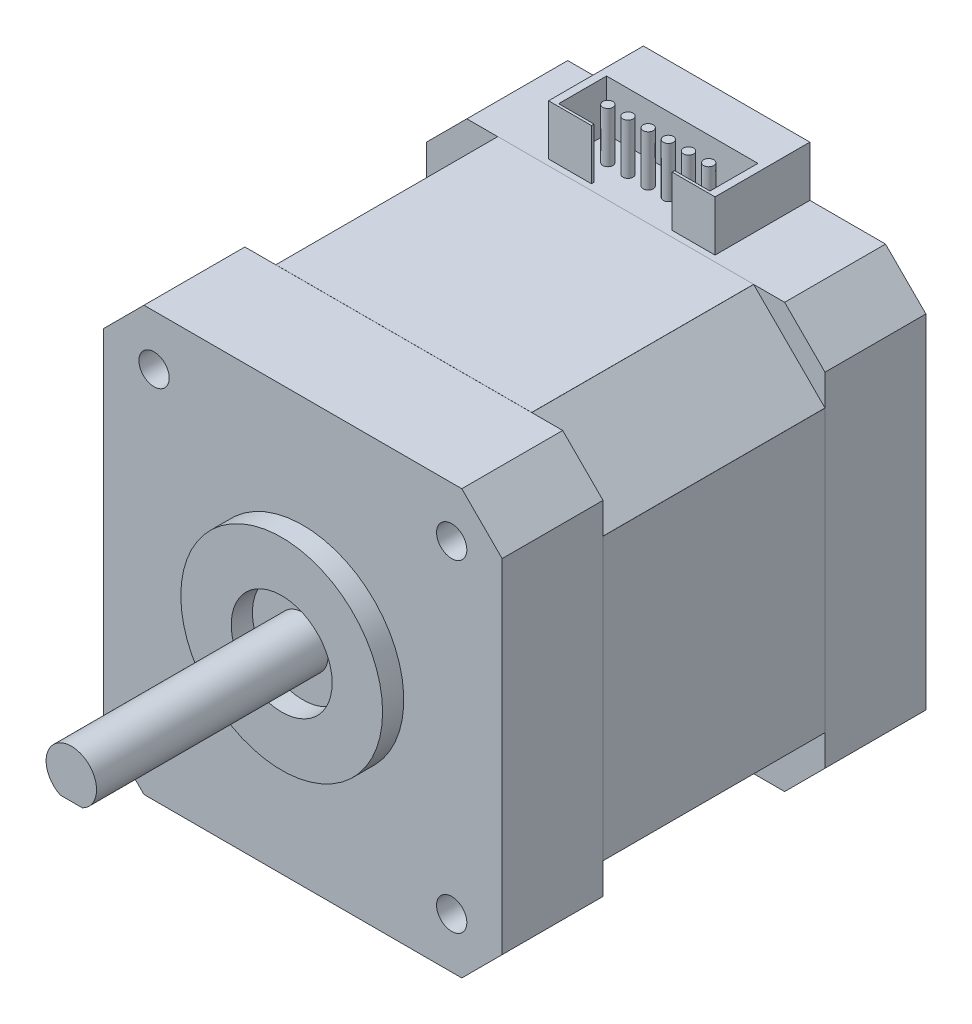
ISO-10303-21;
HEADER;
FILE_DESCRIPTION(('STEP AP214'),'2;1');
FILE_NAME('part.step','',(''),(''),'','','');
FILE_SCHEMA(('AUTOMOTIVE_DESIGN { 1 0 10303 214 1 1 1 1 }'));
ENDSEC;
DATA;
#1=APPLICATION_CONTEXT('core data for automotive mechanical design processes');
#2=APPLICATION_PROTOCOL_DEFINITION('international standard','automotive_design',2000,#1);
#3=PRODUCT_CONTEXT('',#1,'mechanical');
#4=PRODUCT('Part','Part','',(#3));
#5=PRODUCT_RELATED_PRODUCT_CATEGORY('part','',(#4));
#6=PRODUCT_DEFINITION_FORMATION('','',#4);
#7=PRODUCT_DEFINITION_CONTEXT('part definition',#1,'design');
#8=PRODUCT_DEFINITION('design','',#6,#7);
#9=PRODUCT_DEFINITION_SHAPE('','',#8);
#10=(LENGTH_UNIT() NAMED_UNIT(*) SI_UNIT(.MILLI.,.METRE.));
#11=(NAMED_UNIT(*) PLANE_ANGLE_UNIT() SI_UNIT($,.RADIAN.));
#12=(NAMED_UNIT(*) SI_UNIT($,.STERADIAN.) SOLID_ANGLE_UNIT());
#13=UNCERTAINTY_MEASURE_WITH_UNIT(LENGTH_MEASURE(1.E-05),#10,'distance_accuracy_value','');
#14=(GEOMETRIC_REPRESENTATION_CONTEXT(3) GLOBAL_UNCERTAINTY_ASSIGNED_CONTEXT((#13)) GLOBAL_UNIT_ASSIGNED_CONTEXT((#10,
#11,#12)) REPRESENTATION_CONTEXT('',''));
#15=CARTESIAN_POINT('',(0.,0.,0.));
#16=DIRECTION('',(0.,0.,1.));
#17=DIRECTION('',(1.,0.,0.));
#18=AXIS2_PLACEMENT_3D('',#15,#16,#17);
#19=CARTESIAN_POINT('',(-19.75,0.,0.));
#20=DIRECTION('',(-1.,0.,0.));
#21=DIRECTION('',(0.,0.,1.));
#22=AXIS2_PLACEMENT_3D('',#19,#20,#21);
#23=PLANE('',#22);
#24=DIRECTION('',(0.,-1.,0.));
#25=VECTOR('',#24,1.);
#26=CARTESIAN_POINT('',(-19.75,13.9289321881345,-11.));
#27=LINE('',#26,#25);
#28=CARTESIAN_POINT('',(-19.75,13.9289321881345,-11.));
#29=VERTEX_POINT('',#28);
#30=CARTESIAN_POINT('',(-19.75,-13.9289321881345,-11.));
#31=VERTEX_POINT('',#30);
#32=EDGE_CURVE('E355',#29,#31,#27,.T.);
#33=ORIENTED_EDGE('',*,*,#32,.F.);
#34=DIRECTION('',(0.,-1.,0.));
#35=VECTOR('',#34,1.);
#36=CARTESIAN_POINT('',(-19.75,13.9289321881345,-11.));
#37=LINE('',#36,#35);
#38=CARTESIAN_POINT('',(-19.75,17.,-11.));
#39=VERTEX_POINT('',#38);
#40=EDGE_CURVE('E588',#39,#29,#37,.T.);
#41=ORIENTED_EDGE('',*,*,#40,.F.);
#42=DIRECTION('',(0.,0.,-1.));
#43=VECTOR('',#42,1.);
#44=CARTESIAN_POINT('',(-19.75,17.,-21.));
#45=LINE('',#44,#43);
#46=CARTESIAN_POINT('',(-19.75,17.,-21.));
#47=VERTEX_POINT('',#46);
#48=EDGE_CURVE('E732',#39,#47,#45,.T.);
#49=ORIENTED_EDGE('',*,*,#48,.T.);
#50=DIRECTION('',(0.,1.,0.));
#51=VECTOR('',#50,1.);
#52=CARTESIAN_POINT('',(-19.75,-21.,-21.));
#53=LINE('',#52,#51);
#54=CARTESIAN_POINT('',(-19.75,-17.,-21.));
#55=VERTEX_POINT('',#54);
#56=EDGE_CURVE('E675',#55,#47,#53,.T.);
#57=ORIENTED_EDGE('',*,*,#56,.F.);
#58=DIRECTION('',(0.,0.,1.));
#59=VECTOR('',#58,1.);
#60=CARTESIAN_POINT('',(-19.75,-17.,21.));
#61=LINE('',#60,#59);
#62=CARTESIAN_POINT('',(-19.75,-17.,-11.));
#63=VERTEX_POINT('',#62);
#64=EDGE_CURVE('E737',#55,#63,#61,.T.);
#65=ORIENTED_EDGE('',*,*,#64,.T.);
#66=DIRECTION('',(0.,-1.,0.));
#67=VECTOR('',#66,1.);
#68=CARTESIAN_POINT('',(-19.75,-21.,-11.));
#69=LINE('',#68,#67);
#70=EDGE_CURVE('E567',#31,#63,#69,.T.);
#71=ORIENTED_EDGE('',*,*,#70,.F.);
#72=EDGE_LOOP('',(#33,#41,#49,#57,#65,#71));
#73=FACE_BOUND('',#72,.T.);
#74=ADVANCED_FACE('F36',(#73),#23,.T.);
#75=CARTESIAN_POINT('',(19.75,-21.,21.));
#76=DIRECTION('',(0.,1.,0.));
#77=DIRECTION('',(0.,0.,1.));
#78=AXIS2_PLACEMENT_3D('',#75,#76,#77);
#79=PLANE('',#78);
#80=DIRECTION('',(-1.,0.,0.));
#81=VECTOR('',#80,1.);
#82=CARTESIAN_POINT('',(-12.6789321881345,-21.,11.));
#83=LINE('',#82,#81);
#84=CARTESIAN_POINT('',(12.6789321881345,-21.,11.));
#85=VERTEX_POINT('',#84);
#86=CARTESIAN_POINT('',(-12.6789321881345,-21.,11.));
#87=VERTEX_POINT('',#86);
#88=EDGE_CURVE('E359',#85,#87,#83,.T.);
#89=ORIENTED_EDGE('',*,*,#88,.F.);
#90=DIRECTION('',(1.,0.,0.));
#91=VECTOR('',#90,1.);
#92=CARTESIAN_POINT('',(12.6789321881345,-21.,11.));
#93=LINE('',#92,#91);
#94=CARTESIAN_POINT('',(15.75,-21.,11.));
#95=VERTEX_POINT('',#94);
#96=EDGE_CURVE('E549',#85,#95,#93,.T.);
#97=ORIENTED_EDGE('',*,*,#96,.T.);
#98=DIRECTION('',(0.,0.,1.));
#99=VECTOR('',#98,1.);
#100=CARTESIAN_POINT('',(15.75,-21.,21.));
#101=LINE('',#100,#99);
#102=CARTESIAN_POINT('',(15.75,-21.,21.));
#103=VERTEX_POINT('',#102);
#104=EDGE_CURVE('E720',#95,#103,#101,.T.);
#105=ORIENTED_EDGE('',*,*,#104,.T.);
#106=DIRECTION('',(-1.,0.,0.));
#107=VECTOR('',#106,1.);
#108=CARTESIAN_POINT('',(19.75,-21.,21.));
#109=LINE('',#108,#107);
#110=CARTESIAN_POINT('',(-15.75,-21.,21.));
#111=VERTEX_POINT('',#110);
#112=EDGE_CURVE('E690',#103,#111,#109,.T.);
#113=ORIENTED_EDGE('',*,*,#112,.T.);
#114=DIRECTION('',(0.,0.,-1.));
#115=VECTOR('',#114,1.);
#116=CARTESIAN_POINT('',(-15.75,-21.,-21.));
#117=LINE('',#116,#115);
#118=CARTESIAN_POINT('',(-15.75,-21.,11.));
#119=VERTEX_POINT('',#118);
#120=EDGE_CURVE('E717',#111,#119,#117,.T.);
#121=ORIENTED_EDGE('',*,*,#120,.T.);
#122=DIRECTION('',(1.,0.,0.));
#123=VECTOR('',#122,1.);
#124=CARTESIAN_POINT('',(-12.6789321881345,-21.,11.));
#125=LINE('',#124,#123);
#126=EDGE_CURVE('E579',#119,#87,#125,.T.);
#127=ORIENTED_EDGE('',*,*,#126,.T.);
#128=EDGE_LOOP('',(#89,#97,#105,#113,#121,#127));
#129=FACE_BOUND('',#128,.T.);
#130=ADVANCED_FACE('F883',(#129),#79,.F.);
#131=DIRECTION('',(1.,0.,0.));
#132=VECTOR('',#131,1.);
#133=CARTESIAN_POINT('',(-12.6789321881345,-21.,-11.));
#134=LINE('',#133,#132);
#135=CARTESIAN_POINT('',(-12.6789321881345,-21.,-11.));
#136=VERTEX_POINT('',#135);
#137=CARTESIAN_POINT('',(12.6789321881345,-21.,-11.));
#138=VERTEX_POINT('',#137);
#139=EDGE_CURVE('E356',#136,#138,#134,.T.);
#140=ORIENTED_EDGE('',*,*,#139,.F.);
#141=DIRECTION('',(1.,0.,0.));
#142=VECTOR('',#141,1.);
#143=CARTESIAN_POINT('',(-12.6789321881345,-21.,-11.));
#144=LINE('',#143,#142);
#145=CARTESIAN_POINT('',(-15.75,-21.,-11.));
#146=VERTEX_POINT('',#145);
#147=EDGE_CURVE('E569',#146,#136,#144,.T.);
#148=ORIENTED_EDGE('',*,*,#147,.F.);
#149=CARTESIAN_POINT('',(-15.75,-21.,-21.));
#150=VERTEX_POINT('',#149);
#151=EDGE_CURVE('E716',#146,#150,#117,.T.);
#152=ORIENTED_EDGE('',*,*,#151,.T.);
#153=DIRECTION('',(-1.,0.,0.));
#154=VECTOR('',#153,1.);
#155=CARTESIAN_POINT('',(19.75,-21.,-21.));
#156=LINE('',#155,#154);
#157=CARTESIAN_POINT('',(15.75,-21.,-21.));
#158=VERTEX_POINT('',#157);
#159=EDGE_CURVE('E683',#158,#150,#156,.T.);
#160=ORIENTED_EDGE('',*,*,#159,.F.);
#161=CARTESIAN_POINT('',(15.75,-21.,-11.));
#162=VERTEX_POINT('',#161);
#163=EDGE_CURVE('E721',#158,#162,#101,.T.);
#164=ORIENTED_EDGE('',*,*,#163,.T.);
#165=DIRECTION('',(1.,0.,0.));
#166=VECTOR('',#165,1.);
#167=CARTESIAN_POINT('',(12.6789321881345,-21.,-11.));
#168=LINE('',#167,#166);
#169=EDGE_CURVE('E552',#138,#162,#168,.T.);
#170=ORIENTED_EDGE('',*,*,#169,.F.);
#171=EDGE_LOOP('',(#140,#148,#152,#160,#164,#170));
#172=FACE_BOUND('',#171,.T.);
#173=ADVANCED_FACE('F890',(#172),#79,.F.);
#174=CARTESIAN_POINT('',(19.75,0.,0.));
#175=DIRECTION('',(-1.,0.,0.));
#176=DIRECTION('',(0.,0.,1.));
#177=AXIS2_PLACEMENT_3D('',#174,#175,#176);
#178=PLANE('',#177);
#179=DIRECTION('',(0.,-1.,0.));
#180=VECTOR('',#179,1.);
#181=CARTESIAN_POINT('',(19.75,13.9289321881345,11.));
#182=LINE('',#181,#180);
#183=CARTESIAN_POINT('',(19.75,13.9289321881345,11.));
#184=VERTEX_POINT('',#183);
#185=CARTESIAN_POINT('',(19.75,-13.9289321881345,11.));
#186=VERTEX_POINT('',#185);
#187=EDGE_CURVE('E388',#184,#186,#182,.T.);
#188=ORIENTED_EDGE('',*,*,#187,.F.);
#189=DIRECTION('',(0.,1.,0.));
#190=VECTOR('',#189,1.);
#191=CARTESIAN_POINT('',(19.75,21.,11.));
#192=LINE('',#191,#190);
#193=CARTESIAN_POINT('',(19.75,17.,11.));
#194=VERTEX_POINT('',#193);
#195=EDGE_CURVE('E534',#184,#194,#192,.T.);
#196=ORIENTED_EDGE('',*,*,#195,.T.);
#197=DIRECTION('',(0.,0.,1.));
#198=VECTOR('',#197,1.);
#199=CARTESIAN_POINT('',(19.75,17.,0.));
#200=LINE('',#199,#198);
#201=CARTESIAN_POINT('',(19.75,17.,21.));
#202=VERTEX_POINT('',#201);
#203=EDGE_CURVE('E699',#194,#202,#200,.T.);
#204=ORIENTED_EDGE('',*,*,#203,.T.);
#205=DIRECTION('',(0.,-1.,0.));
#206=VECTOR('',#205,1.);
#207=CARTESIAN_POINT('',(19.75,-21.,21.));
#208=LINE('',#207,#206);
#209=CARTESIAN_POINT('',(19.75,-17.,21.));
#210=VERTEX_POINT('',#209);
#211=EDGE_CURVE('E679',#202,#210,#208,.T.);
#212=ORIENTED_EDGE('',*,*,#211,.T.);
#213=DIRECTION('',(0.,0.,-1.));
#214=VECTOR('',#213,1.);
#215=CARTESIAN_POINT('',(19.75,-17.,0.));
#216=LINE('',#215,#214);
#217=CARTESIAN_POINT('',(19.75,-17.,11.));
#218=VERTEX_POINT('',#217);
#219=EDGE_CURVE('E704',#210,#218,#216,.T.);
#220=ORIENTED_EDGE('',*,*,#219,.T.);
#221=DIRECTION('',(0.,1.,0.));
#222=VECTOR('',#221,1.);
#223=CARTESIAN_POINT('',(19.75,-21.,11.));
#224=LINE('',#223,#222);
#225=EDGE_CURVE('E555',#218,#186,#224,.T.);
#226=ORIENTED_EDGE('',*,*,#225,.T.);
#227=EDGE_LOOP('',(#188,#196,#204,#212,#220,#226));
#228=FACE_BOUND('',#227,.T.);
#229=ADVANCED_FACE('F842',(#228),#178,.F.);
#230=DIRECTION('',(0.,1.,0.));
#231=VECTOR('',#230,1.);
#232=CARTESIAN_POINT('',(19.75,13.9289321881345,-11.));
#233=LINE('',#232,#231);
#234=CARTESIAN_POINT('',(19.75,-13.9289321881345,-11.));
#235=VERTEX_POINT('',#234);
#236=CARTESIAN_POINT('',(19.75,13.9289321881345,-11.));
#237=VERTEX_POINT('',#236);
#238=EDGE_CURVE('E393',#235,#237,#233,.T.);
#239=ORIENTED_EDGE('',*,*,#238,.F.);
#240=DIRECTION('',(0.,1.,0.));
#241=VECTOR('',#240,1.);
#242=CARTESIAN_POINT('',(19.75,-21.,-11.));
#243=LINE('',#242,#241);
#244=CARTESIAN_POINT('',(19.75,-17.,-11.));
#245=VERTEX_POINT('',#244);
#246=EDGE_CURVE('E545',#245,#235,#243,.T.);
#247=ORIENTED_EDGE('',*,*,#246,.F.);
#248=CARTESIAN_POINT('',(19.75,-17.,-21.));
#249=VERTEX_POINT('',#248);
#250=EDGE_CURVE('E703',#245,#249,#216,.T.);
#251=ORIENTED_EDGE('',*,*,#250,.T.);
#252=DIRECTION('',(0.,1.,0.));
#253=VECTOR('',#252,1.);
#254=CARTESIAN_POINT('',(19.75,-21.,-21.));
#255=LINE('',#254,#253);
#256=CARTESIAN_POINT('',(19.75,17.,-21.));
#257=VERTEX_POINT('',#256);
#258=EDGE_CURVE('E676',#249,#257,#255,.T.);
#259=ORIENTED_EDGE('',*,*,#258,.T.);
#260=CARTESIAN_POINT('',(19.75,17.,-11.));
#261=VERTEX_POINT('',#260);
#262=EDGE_CURVE('E700',#257,#261,#200,.T.);
#263=ORIENTED_EDGE('',*,*,#262,.T.);
#264=DIRECTION('',(0.,1.,0.));
#265=VECTOR('',#264,1.);
#266=CARTESIAN_POINT('',(19.75,21.,-11.));
#267=LINE('',#266,#265);
#268=EDGE_CURVE('E524',#237,#261,#267,.T.);
#269=ORIENTED_EDGE('',*,*,#268,.F.);
#270=EDGE_LOOP('',(#239,#247,#251,#259,#263,#269));
#271=FACE_BOUND('',#270,.T.);
#272=ADVANCED_FACE('F861',(#271),#178,.F.);
#273=CARTESIAN_POINT('',(19.75,21.,21.));
#274=DIRECTION('',(0.,-1.,0.));
#275=DIRECTION('',(0.,0.,-1.));
#276=AXIS2_PLACEMENT_3D('',#273,#274,#275);
#277=PLANE('',#276);
#278=DIRECTION('',(1.,0.,0.));
#279=VECTOR('',#278,1.);
#280=CARTESIAN_POINT('',(-12.6789321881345,21.,11.));
#281=LINE('',#280,#279);
#282=CARTESIAN_POINT('',(-12.6789321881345,21.,11.));
#283=VERTEX_POINT('',#282);
#284=CARTESIAN_POINT('',(12.6789321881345,21.,11.));
#285=VERTEX_POINT('',#284);
#286=EDGE_CURVE('E415',#283,#285,#281,.T.);
#287=ORIENTED_EDGE('',*,*,#286,.F.);
#288=DIRECTION('',(-1.,0.,0.));
#289=VECTOR('',#288,1.);
#290=CARTESIAN_POINT('',(-19.75,21.,11.));
#291=LINE('',#290,#289);
#292=CARTESIAN_POINT('',(-15.75,21.,11.));
#293=VERTEX_POINT('',#292);
#294=EDGE_CURVE('E542',#283,#293,#291,.T.);
#295=ORIENTED_EDGE('',*,*,#294,.T.);
#296=DIRECTION('',(0.,0.,1.));
#297=VECTOR('',#296,1.);
#298=CARTESIAN_POINT('',(-15.75,21.,21.));
#299=LINE('',#298,#297);
#300=CARTESIAN_POINT('',(-15.75,21.,21.));
#301=VERTEX_POINT('',#300);
#302=EDGE_CURVE('E744',#293,#301,#299,.T.);
#303=ORIENTED_EDGE('',*,*,#302,.T.);
#304=DIRECTION('',(-1.,0.,0.));
#305=VECTOR('',#304,1.);
#306=CARTESIAN_POINT('',(19.75,21.,21.));
#307=LINE('',#306,#305);
#308=CARTESIAN_POINT('',(15.75,21.,21.));
#309=VERTEX_POINT('',#308);
#310=EDGE_CURVE('E693',#309,#301,#307,.T.);
#311=ORIENTED_EDGE('',*,*,#310,.F.);
#312=DIRECTION('',(0.,0.,-1.));
#313=VECTOR('',#312,1.);
#314=CARTESIAN_POINT('',(15.75,21.,21.));
#315=LINE('',#314,#313);
#316=CARTESIAN_POINT('',(15.75,21.,11.));
#317=VERTEX_POINT('',#316);
#318=EDGE_CURVE('E741',#309,#317,#315,.T.);
#319=ORIENTED_EDGE('',*,*,#318,.T.);
#320=DIRECTION('',(-1.,0.,0.));
#321=VECTOR('',#320,1.);
#322=CARTESIAN_POINT('',(12.6789321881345,21.,11.));
#323=LINE('',#322,#321);
#324=EDGE_CURVE('E525',#317,#285,#323,.T.);
#325=ORIENTED_EDGE('',*,*,#324,.T.);
#326=EDGE_LOOP('',(#287,#295,#303,#311,#319,#325));
#327=FACE_BOUND('',#326,.T.);
#328=ADVANCED_FACE('F795',(#327),#277,.F.);
#329=CARTESIAN_POINT('',(-1.,21.,-14.225));
#330=DIRECTION('',(0.,-1.,0.));
#331=DIRECTION('',(0.,0.,-1.));
#332=AXIS2_PLACEMENT_3D('',#329,#330,#331);
#333=CIRCLE('',#332,0.500000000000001);
#334=CARTESIAN_POINT('',(-1.,21.,-14.725));
#335=VERTEX_POINT('',#334);
#336=EDGE_CURVE('E774',#335,#335,#333,.F.);
#337=ORIENTED_EDGE('',*,*,#336,.F.);
#338=EDGE_LOOP('',(#337));
#339=FACE_BOUND('',#338,.T.);
#340=CARTESIAN_POINT('',(0.999999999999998,21.,-14.225));
#341=DIRECTION('',(0.,-1.,0.));
#342=DIRECTION('',(0.,0.,-1.));
#343=AXIS2_PLACEMENT_3D('',#340,#341,#342);
#344=CIRCLE('',#343,0.5);
#345=CARTESIAN_POINT('',(0.999999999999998,21.,-14.725));
#346=VERTEX_POINT('',#345);
#347=EDGE_CURVE('E777',#346,#346,#344,.F.);
#348=ORIENTED_EDGE('',*,*,#347,.F.);
#349=EDGE_LOOP('',(#348));
#350=FACE_BOUND('',#349,.T.);
#351=CARTESIAN_POINT('',(3.,21.,-14.225));
#352=DIRECTION('',(0.,-1.,0.));
#353=DIRECTION('',(0.,0.,-1.));
#354=AXIS2_PLACEMENT_3D('',#351,#352,#353);
#355=CIRCLE('',#354,0.500000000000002);
#356=CARTESIAN_POINT('',(3.,21.,-14.725));
#357=VERTEX_POINT('',#356);
#358=EDGE_CURVE('E780',#357,#357,#355,.F.);
#359=ORIENTED_EDGE('',*,*,#358,.F.);
#360=EDGE_LOOP('',(#359));
#361=FACE_BOUND('',#360,.T.);
#362=CARTESIAN_POINT('',(5.,21.,-14.225));
#363=DIRECTION('',(0.,-1.,0.));
#364=DIRECTION('',(0.,0.,-1.));
#365=AXIS2_PLACEMENT_3D('',#362,#363,#364);
#366=CIRCLE('',#365,0.500000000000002);
#367=CARTESIAN_POINT('',(5.,21.,-14.725));
#368=VERTEX_POINT('',#367);
#369=EDGE_CURVE('E783',#368,#368,#366,.F.);
#370=ORIENTED_EDGE('',*,*,#369,.F.);
#371=EDGE_LOOP('',(#370));
#372=FACE_BOUND('',#371,.T.);
#373=CARTESIAN_POINT('',(-3.,21.,-14.225));
#374=DIRECTION('',(0.,-1.,0.));
#375=DIRECTION('',(0.,0.,-1.));
#376=AXIS2_PLACEMENT_3D('',#373,#374,#375);
#377=CIRCLE('',#376,0.5);
#378=CARTESIAN_POINT('',(-3.,21.,-14.725));
#379=VERTEX_POINT('',#378);
#380=EDGE_CURVE('E45',#379,#379,#377,.F.);
#381=ORIENTED_EDGE('',*,*,#380,.F.);
#382=EDGE_LOOP('',(#381));
#383=FACE_BOUND('',#382,.T.);
#384=CARTESIAN_POINT('',(-5.,21.,-14.225));
#385=DIRECTION('',(0.,-1.,0.));
#386=DIRECTION('',(0.,0.,-1.));
#387=AXIS2_PLACEMENT_3D('',#384,#385,#386);
#388=CIRCLE('',#387,0.500000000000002);
#389=CARTESIAN_POINT('',(-5.,21.,-14.725));
#390=VERTEX_POINT('',#389);
#391=EDGE_CURVE('E11',#390,#390,#388,.F.);
#392=ORIENTED_EDGE('',*,*,#391,.F.);
#393=EDGE_LOOP('',(#392));
#394=FACE_BOUND('',#393,.T.);
#395=DIRECTION('',(-1.,0.,0.));
#396=VECTOR('',#395,1.);
#397=CARTESIAN_POINT('',(-12.6789321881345,21.,-11.));
#398=LINE('',#397,#396);
#399=CARTESIAN_POINT('',(12.6789321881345,21.,-11.));
#400=VERTEX_POINT('',#399);
#401=CARTESIAN_POINT('',(-12.6789321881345,21.,-11.));
#402=VERTEX_POINT('',#401);
#403=EDGE_CURVE('E420',#400,#402,#398,.T.);
#404=ORIENTED_EDGE('',*,*,#403,.F.);
#405=DIRECTION('',(-1.,0.,0.));
#406=VECTOR('',#405,1.);
#407=CARTESIAN_POINT('',(12.6789321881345,21.,-11.));
#408=LINE('',#407,#406);
#409=CARTESIAN_POINT('',(15.75,21.,-11.));
#410=VERTEX_POINT('',#409);
#411=EDGE_CURVE('E527',#410,#400,#408,.T.);
#412=ORIENTED_EDGE('',*,*,#411,.F.);
#413=CARTESIAN_POINT('',(15.75,21.,-21.));
#414=VERTEX_POINT('',#413);
#415=EDGE_CURVE('E740',#410,#414,#315,.T.);
#416=ORIENTED_EDGE('',*,*,#415,.T.);
#417=DIRECTION('',(-1.,0.,0.));
#418=VECTOR('',#417,1.);
#419=CARTESIAN_POINT('',(19.75,21.,-21.));
#420=LINE('',#419,#418);
#421=CARTESIAN_POINT('',(8.25,21.,-21.));
#422=VERTEX_POINT('',#421);
#423=EDGE_CURVE('E697',#414,#422,#420,.T.);
#424=ORIENTED_EDGE('',*,*,#423,.T.);
#425=DIRECTION('',(0.,0.,-1.));
#426=VECTOR('',#425,1.);
#427=CARTESIAN_POINT('',(8.25,21.,-21.));
#428=LINE('',#427,#426);
#429=CARTESIAN_POINT('',(8.25,21.,-11.6));
#430=VERTEX_POINT('',#429);
#431=EDGE_CURVE('E611',#430,#422,#428,.T.);
#432=ORIENTED_EDGE('',*,*,#431,.F.);
#433=DIRECTION('',(1.,0.,0.));
#434=VECTOR('',#433,1.);
#435=CARTESIAN_POINT('',(-8.25,21.,-11.6));
#436=LINE('',#435,#434);
#437=CARTESIAN_POINT('',(4.,21.,-11.6));
#438=VERTEX_POINT('',#437);
#439=EDGE_CURVE('E622',#438,#430,#436,.T.);
#440=ORIENTED_EDGE('',*,*,#439,.F.);
#441=DIRECTION('',(0.,0.,1.));
#442=VECTOR('',#441,1.);
#443=CARTESIAN_POINT('',(4.,21.,0.));
#444=LINE('',#443,#442);
#445=CARTESIAN_POINT('',(4.,21.,-11.85));
#446=VERTEX_POINT('',#445);
#447=EDGE_CURVE('E490',#446,#438,#444,.T.);
#448=ORIENTED_EDGE('',*,*,#447,.F.);
#449=DIRECTION('',(1.,0.,0.));
#450=VECTOR('',#449,1.);
#451=CARTESIAN_POINT('',(0.,21.,-11.85));
#452=LINE('',#451,#450);
#453=CARTESIAN_POINT('',(7.5,21.,-11.85));
#454=VERTEX_POINT('',#453);
#455=EDGE_CURVE('E480',#446,#454,#452,.T.);
#456=ORIENTED_EDGE('',*,*,#455,.T.);
#457=DIRECTION('',(0.,0.,1.));
#458=VECTOR('',#457,1.);
#459=CARTESIAN_POINT('',(7.5,21.,0.));
#460=LINE('',#459,#458);
#461=CARTESIAN_POINT('',(7.5,21.,-16.6));
#462=VERTEX_POINT('',#461);
#463=EDGE_CURVE('E493',#462,#454,#460,.T.);
#464=ORIENTED_EDGE('',*,*,#463,.F.);
#465=DIRECTION('',(1.,0.,0.));
#466=VECTOR('',#465,1.);
#467=CARTESIAN_POINT('',(0.,21.,-16.6));
#468=LINE('',#467,#466);
#469=CARTESIAN_POINT('',(-7.5,21.,-16.6));
#470=VERTEX_POINT('',#469);
#471=EDGE_CURVE('E498',#470,#462,#468,.T.);
#472=ORIENTED_EDGE('',*,*,#471,.F.);
#473=DIRECTION('',(0.,0.,1.));
#474=VECTOR('',#473,1.);
#475=CARTESIAN_POINT('',(-7.49999999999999,21.,0.));
#476=LINE('',#475,#474);
#477=CARTESIAN_POINT('',(-7.5,21.,-11.85));
#478=VERTEX_POINT('',#477);
#479=EDGE_CURVE('E481',#470,#478,#476,.T.);
#480=ORIENTED_EDGE('',*,*,#479,.T.);
#481=DIRECTION('',(1.,0.,0.));
#482=VECTOR('',#481,1.);
#483=CARTESIAN_POINT('',(0.,21.,-11.85));
#484=LINE('',#483,#482);
#485=CARTESIAN_POINT('',(-4.,21.,-11.85));
#486=VERTEX_POINT('',#485);
#487=EDGE_CURVE('E485',#478,#486,#484,.T.);
#488=ORIENTED_EDGE('',*,*,#487,.T.);
#489=DIRECTION('',(0.,0.,1.));
#490=VECTOR('',#489,1.);
#491=CARTESIAN_POINT('',(-4.,21.,0.));
#492=LINE('',#491,#490);
#493=CARTESIAN_POINT('',(-4.,21.,-11.6));
#494=VERTEX_POINT('',#493);
#495=EDGE_CURVE('E488',#486,#494,#492,.T.);
#496=ORIENTED_EDGE('',*,*,#495,.T.);
#497=CARTESIAN_POINT('',(-8.25,21.,-11.6));
#498=VERTEX_POINT('',#497);
#499=EDGE_CURVE('E623',#498,#494,#436,.T.);
#500=ORIENTED_EDGE('',*,*,#499,.F.);
#501=DIRECTION('',(0.,0.,1.));
#502=VECTOR('',#501,1.);
#503=CARTESIAN_POINT('',(-8.25,21.,-21.));
#504=LINE('',#503,#502);
#505=CARTESIAN_POINT('',(-8.25,21.,-21.));
#506=VERTEX_POINT('',#505);
#507=EDGE_CURVE('E604',#506,#498,#504,.T.);
#508=ORIENTED_EDGE('',*,*,#507,.F.);
#509=CARTESIAN_POINT('',(-15.75,21.,-21.));
#510=VERTEX_POINT('',#509);
#511=EDGE_CURVE('E696',#506,#510,#420,.T.);
#512=ORIENTED_EDGE('',*,*,#511,.T.);
#513=CARTESIAN_POINT('',(-15.75,21.,-11.));
#514=VERTEX_POINT('',#513);
#515=EDGE_CURVE('E745',#510,#514,#299,.T.);
#516=ORIENTED_EDGE('',*,*,#515,.T.);
#517=DIRECTION('',(-1.,0.,0.));
#518=VECTOR('',#517,1.);
#519=CARTESIAN_POINT('',(-19.75,21.,-11.));
#520=LINE('',#519,#518);
#521=EDGE_CURVE('E586',#402,#514,#520,.T.);
#522=ORIENTED_EDGE('',*,*,#521,.F.);
#523=EDGE_LOOP('',(#404,#412,#416,#424,#432,#440,#448,#456,#464,#472,#480,#488,#496,#500,#508,
#512,#516,#522));
#524=FACE_BOUND('',#523,.T.);
#525=ADVANCED_FACE('F791',(#339,#350,#361,#372,#383,#394,#524),#277,.F.);
#526=CARTESIAN_POINT('',(-8.25,26.,-11.6));
#527=DIRECTION('',(0.,0.,-1.));
#528=DIRECTION('',(-1.,0.,0.));
#529=AXIS2_PLACEMENT_3D('',#526,#527,#528);
#530=PLANE('',#529);
#531=DIRECTION('',(0.,1.,0.));
#532=VECTOR('',#531,1.);
#533=CARTESIAN_POINT('',(4.,5.18861169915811,-11.6));
#534=LINE('',#533,#532);
#535=CARTESIAN_POINT('',(4.,26.,-11.6));
#536=VERTEX_POINT('',#535);
#537=EDGE_CURVE('E464',#438,#536,#534,.T.);
#538=ORIENTED_EDGE('',*,*,#537,.F.);
#539=ORIENTED_EDGE('',*,*,#439,.T.);
#540=DIRECTION('',(0.,-1.,0.));
#541=VECTOR('',#540,1.);
#542=CARTESIAN_POINT('',(8.25,26.,-11.6));
#543=LINE('',#542,#541);
#544=CARTESIAN_POINT('',(8.25,26.,-11.6));
#545=VERTEX_POINT('',#544);
#546=EDGE_CURVE('E633',#545,#430,#543,.T.);
#547=ORIENTED_EDGE('',*,*,#546,.F.);
#548=DIRECTION('',(1.,0.,0.));
#549=VECTOR('',#548,1.);
#550=CARTESIAN_POINT('',(-8.25,26.,-11.6));
#551=LINE('',#550,#549);
#552=EDGE_CURVE('E610',#536,#545,#551,.T.);
#553=ORIENTED_EDGE('',*,*,#552,.F.);
#554=EDGE_LOOP('',(#538,#539,#547,#553));
#555=FACE_BOUND('',#554,.T.);
#556=ADVANCED_FACE('F794',(#555),#530,.F.);
#557=CARTESIAN_POINT('',(0.,26.,0.));
#558=DIRECTION('',(0.,1.,0.));
#559=DIRECTION('',(0.,0.,1.));
#560=AXIS2_PLACEMENT_3D('',#557,#558,#559);
#561=PLANE('',#560);
#562=DIRECTION('',(1.,0.,0.));
#563=VECTOR('',#562,1.);
#564=CARTESIAN_POINT('',(0.,26.,-11.85));
#565=LINE('',#564,#563);
#566=CARTESIAN_POINT('',(4.,26.,-11.85));
#567=VERTEX_POINT('',#566);
#568=CARTESIAN_POINT('',(7.5,26.,-11.85));
#569=VERTEX_POINT('',#568);
#570=EDGE_CURVE('E468',#567,#569,#565,.T.);
#571=ORIENTED_EDGE('',*,*,#570,.F.);
#572=DIRECTION('',(0.,0.,1.));
#573=VECTOR('',#572,1.);
#574=CARTESIAN_POINT('',(4.,26.,0.));
#575=LINE('',#574,#573);
#576=EDGE_CURVE('E461',#567,#536,#575,.T.);
#577=ORIENTED_EDGE('',*,*,#576,.T.);
#578=ORIENTED_EDGE('',*,*,#552,.T.);
#579=DIRECTION('',(0.,0.,-1.));
#580=VECTOR('',#579,1.);
#581=CARTESIAN_POINT('',(8.25,26.,-21.));
#582=LINE('',#581,#580);
#583=CARTESIAN_POINT('',(8.25,26.,-21.));
#584=VERTEX_POINT('',#583);
#585=EDGE_CURVE('E615',#545,#584,#582,.T.);
#586=ORIENTED_EDGE('',*,*,#585,.T.);
#587=DIRECTION('',(-1.,0.,0.));
#588=VECTOR('',#587,1.);
#589=CARTESIAN_POINT('',(-8.25,26.,-21.));
#590=LINE('',#589,#588);
#591=CARTESIAN_POINT('',(-8.25,26.,-21.));
#592=VERTEX_POINT('',#591);
#593=EDGE_CURVE('E617',#584,#592,#590,.T.);
#594=ORIENTED_EDGE('',*,*,#593,.T.);
#595=DIRECTION('',(0.,0.,1.));
#596=VECTOR('',#595,1.);
#597=CARTESIAN_POINT('',(-8.25,26.,-21.));
#598=LINE('',#597,#596);
#599=CARTESIAN_POINT('',(-8.25,26.,-11.6));
#600=VERTEX_POINT('',#599);
#601=EDGE_CURVE('E607',#592,#600,#598,.T.);
#602=ORIENTED_EDGE('',*,*,#601,.T.);
#603=CARTESIAN_POINT('',(-4.,26.,-11.6));
#604=VERTEX_POINT('',#603);
#605=EDGE_CURVE('E612',#600,#604,#551,.T.);
#606=ORIENTED_EDGE('',*,*,#605,.T.);
#607=DIRECTION('',(0.,0.,1.));
#608=VECTOR('',#607,1.);
#609=CARTESIAN_POINT('',(-4.,26.,0.));
#610=LINE('',#609,#608);
#611=CARTESIAN_POINT('',(-4.,26.,-11.85));
#612=VERTEX_POINT('',#611);
#613=EDGE_CURVE('E466',#612,#604,#610,.T.);
#614=ORIENTED_EDGE('',*,*,#613,.F.);
#615=CARTESIAN_POINT('',(-7.5,26.,-11.85));
#616=VERTEX_POINT('',#615);
#617=EDGE_CURVE('E469',#616,#612,#565,.T.);
#618=ORIENTED_EDGE('',*,*,#617,.F.);
#619=DIRECTION('',(0.,0.,1.));
#620=VECTOR('',#619,1.);
#621=CARTESIAN_POINT('',(-7.49999999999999,26.,0.));
#622=LINE('',#621,#620);
#623=CARTESIAN_POINT('',(-7.5,26.,-16.6));
#624=VERTEX_POINT('',#623);
#625=EDGE_CURVE('E472',#624,#616,#622,.T.);
#626=ORIENTED_EDGE('',*,*,#625,.F.);
#627=DIRECTION('',(1.,0.,0.));
#628=VECTOR('',#627,1.);
#629=CARTESIAN_POINT('',(0.,26.,-16.6));
#630=LINE('',#629,#628);
#631=CARTESIAN_POINT('',(7.5,26.,-16.6));
#632=VERTEX_POINT('',#631);
#633=EDGE_CURVE('E475',#624,#632,#630,.T.);
#634=ORIENTED_EDGE('',*,*,#633,.T.);
#635=DIRECTION('',(0.,0.,1.));
#636=VECTOR('',#635,1.);
#637=CARTESIAN_POINT('',(7.5,26.,0.));
#638=LINE('',#637,#636);
#639=EDGE_CURVE('E52',#632,#569,#638,.T.);
#640=ORIENTED_EDGE('',*,*,#639,.T.);
#641=EDGE_LOOP('',(#571,#577,#578,#586,#594,#602,#606,#614,#618,#626,#634,#640));
#642=FACE_BOUND('',#641,.T.);
#643=ADVANCED_FACE('F896',(#642),#561,.T.);
#644=DIRECTION('',(0.,1.,0.));
#645=VECTOR('',#644,1.);
#646=CARTESIAN_POINT('',(-19.75,13.9289321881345,11.));
#647=LINE('',#646,#645);
#648=CARTESIAN_POINT('',(-19.75,-13.9289321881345,11.));
#649=VERTEX_POINT('',#648);
#650=CARTESIAN_POINT('',(-19.75,13.9289321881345,11.));
#651=VERTEX_POINT('',#650);
#652=EDGE_CURVE('E352',#649,#651,#647,.T.);
#653=ORIENTED_EDGE('',*,*,#652,.F.);
#654=DIRECTION('',(0.,-1.,0.));
#655=VECTOR('',#654,1.);
#656=CARTESIAN_POINT('',(-19.75,-21.,11.));
#657=LINE('',#656,#655);
#658=CARTESIAN_POINT('',(-19.75,-17.,11.));
#659=VERTEX_POINT('',#658);
#660=EDGE_CURVE('E519',#649,#659,#657,.T.);
#661=ORIENTED_EDGE('',*,*,#660,.T.);
#662=CARTESIAN_POINT('',(-19.75,-17.,21.));
#663=VERTEX_POINT('',#662);
#664=EDGE_CURVE('E736',#659,#663,#61,.T.);
#665=ORIENTED_EDGE('',*,*,#664,.T.);
#666=DIRECTION('',(0.,-1.,0.));
#667=VECTOR('',#666,1.);
#668=CARTESIAN_POINT('',(-19.75,-21.,21.));
#669=LINE('',#668,#667);
#670=CARTESIAN_POINT('',(-19.75,17.,21.));
#671=VERTEX_POINT('',#670);
#672=EDGE_CURVE('E680',#671,#663,#669,.T.);
#673=ORIENTED_EDGE('',*,*,#672,.F.);
#674=CARTESIAN_POINT('',(-19.75,17.,11.));
#675=VERTEX_POINT('',#674);
#676=EDGE_CURVE('E733',#671,#675,#45,.T.);
#677=ORIENTED_EDGE('',*,*,#676,.T.);
#678=DIRECTION('',(0.,-1.,0.));
#679=VECTOR('',#678,1.);
#680=CARTESIAN_POINT('',(-19.75,13.9289321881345,11.));
#681=LINE('',#680,#679);
#682=EDGE_CURVE('E598',#675,#651,#681,.T.);
#683=ORIENTED_EDGE('',*,*,#682,.T.);
#684=EDGE_LOOP('',(#653,#661,#665,#673,#677,#683));
#685=FACE_BOUND('',#684,.T.);
#686=ADVANCED_FACE('F886',(#685),#23,.T.);
#687=CARTESIAN_POINT('',(19.75,-17.,0.));
#688=DIRECTION('',(-0.707106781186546,0.707106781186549,0.));
#689=DIRECTION('',(0.,0.,-1.));
#690=AXIS2_PLACEMENT_3D('',#687,#688,#689);
#691=PLANE('',#690);
#692=ORIENTED_EDGE('',*,*,#104,.F.);
#693=DIRECTION('',(-0.707106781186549,-0.707106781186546,0.));
#694=VECTOR('',#693,1.);
#695=CARTESIAN_POINT('',(19.75,-17.,11.));
#696=LINE('',#695,#694);
#697=EDGE_CURVE('E769',#95,#218,#696,.F.);
#698=ORIENTED_EDGE('',*,*,#697,.T.);
#699=ORIENTED_EDGE('',*,*,#219,.F.);
#700=DIRECTION('',(-0.707106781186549,-0.707106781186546,0.));
#701=VECTOR('',#700,1.);
#702=CARTESIAN_POINT('',(19.75,-17.,21.));
#703=LINE('',#702,#701);
#704=EDGE_CURVE('E730',#103,#210,#703,.F.);
#705=ORIENTED_EDGE('',*,*,#704,.F.);
#706=EDGE_LOOP('',(#692,#698,#699,#705));
#707=FACE_BOUND('',#706,.T.);
#708=ADVANCED_FACE('F895',(#707),#691,.F.);
#709=CARTESIAN_POINT('',(-15.75,-21.,21.));
#710=DIRECTION('',(-0.707106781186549,-0.707106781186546,0.));
#711=DIRECTION('',(0.,0.,1.));
#712=AXIS2_PLACEMENT_3D('',#709,#710,#711);
#713=PLANE('',#712);
#714=ORIENTED_EDGE('',*,*,#151,.F.);
#715=DIRECTION('',(-0.707106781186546,0.707106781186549,0.));
#716=VECTOR('',#715,1.);
#717=CARTESIAN_POINT('',(-15.75,-21.,-11.));
#718=LINE('',#717,#716);
#719=EDGE_CURVE('E766',#146,#63,#718,.T.);
#720=ORIENTED_EDGE('',*,*,#719,.T.);
#721=ORIENTED_EDGE('',*,*,#64,.F.);
#722=DIRECTION('',(-0.707106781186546,0.707106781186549,0.));
#723=VECTOR('',#722,1.);
#724=CARTESIAN_POINT('',(-15.75,-21.,-21.));
#725=LINE('',#724,#723);
#726=EDGE_CURVE('E712',#150,#55,#725,.T.);
#727=ORIENTED_EDGE('',*,*,#726,.F.);
#728=EDGE_LOOP('',(#714,#720,#721,#727));
#729=FACE_BOUND('',#728,.T.);
#730=ADVANCED_FACE('F902',(#729),#713,.T.);
#731=CARTESIAN_POINT('',(-15.75,21.,21.));
#732=DIRECTION('',(-0.707106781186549,0.707106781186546,0.));
#733=DIRECTION('',(0.,0.,-1.));
#734=AXIS2_PLACEMENT_3D('',#731,#732,#733);
#735=PLANE('',#734);
#736=ORIENTED_EDGE('',*,*,#48,.F.);
#737=DIRECTION('',(0.707106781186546,0.707106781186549,0.));
#738=VECTOR('',#737,1.);
#739=CARTESIAN_POINT('',(-15.75,21.,-11.));
#740=LINE('',#739,#738);
#741=EDGE_CURVE('E761',#39,#514,#740,.T.);
#742=ORIENTED_EDGE('',*,*,#741,.T.);
#743=ORIENTED_EDGE('',*,*,#515,.F.);
#744=DIRECTION('',(0.707106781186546,0.707106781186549,0.));
#745=VECTOR('',#744,1.);
#746=CARTESIAN_POINT('',(-15.75,21.,-21.));
#747=LINE('',#746,#745);
#748=EDGE_CURVE('E709',#47,#510,#747,.T.);
#749=ORIENTED_EDGE('',*,*,#748,.F.);
#750=EDGE_LOOP('',(#736,#742,#743,#749));
#751=FACE_BOUND('',#750,.T.);
#752=ADVANCED_FACE('F944',(#751),#735,.T.);
#753=CARTESIAN_POINT('',(19.75,17.,0.));
#754=DIRECTION('',(-0.707106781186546,-0.707106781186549,0.));
#755=DIRECTION('',(0.,0.,1.));
#756=AXIS2_PLACEMENT_3D('',#753,#754,#755);
#757=PLANE('',#756);
#758=ORIENTED_EDGE('',*,*,#203,.F.);
#759=DIRECTION('',(0.707106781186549,-0.707106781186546,0.));
#760=VECTOR('',#759,1.);
#761=CARTESIAN_POINT('',(19.75,17.,11.));
#762=LINE('',#761,#760);
#763=EDGE_CURVE('E754',#194,#317,#762,.F.);
#764=ORIENTED_EDGE('',*,*,#763,.T.);
#765=ORIENTED_EDGE('',*,*,#318,.F.);
#766=DIRECTION('',(0.707106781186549,-0.707106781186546,0.));
#767=VECTOR('',#766,1.);
#768=CARTESIAN_POINT('',(19.75,17.,21.));
#769=LINE('',#768,#767);
#770=EDGE_CURVE('E724',#202,#309,#769,.F.);
#771=ORIENTED_EDGE('',*,*,#770,.F.);
#772=EDGE_LOOP('',(#758,#764,#765,#771));
#773=FACE_BOUND('',#772,.T.);
#774=ADVANCED_FACE('F838',(#773),#757,.F.);
#775=CARTESIAN_POINT('',(19.75,-21.,-21.));
#776=DIRECTION('',(0.,0.,1.));
#777=DIRECTION('',(1.,0.,0.));
#778=AXIS2_PLACEMENT_3D('',#775,#776,#777);
#779=PLANE('',#778);
#780=ORIENTED_EDGE('',*,*,#258,.F.);
#781=DIRECTION('',(0.707106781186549,0.707106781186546,0.));
#782=VECTOR('',#781,1.);
#783=CARTESIAN_POINT('',(19.75,-17.,-21.));
#784=LINE('',#783,#782);
#785=EDGE_CURVE('E714',#249,#158,#784,.F.);
#786=ORIENTED_EDGE('',*,*,#785,.T.);
#787=ORIENTED_EDGE('',*,*,#159,.T.);
#788=ORIENTED_EDGE('',*,*,#726,.T.);
#789=ORIENTED_EDGE('',*,*,#56,.T.);
#790=ORIENTED_EDGE('',*,*,#748,.T.);
#791=ORIENTED_EDGE('',*,*,#511,.F.);
#792=DIRECTION('',(0.,-1.,0.));
#793=VECTOR('',#792,1.);
#794=CARTESIAN_POINT('',(-8.25,26.,-21.));
#795=LINE('',#794,#793);
#796=EDGE_CURVE('E619',#592,#506,#795,.T.);
#797=ORIENTED_EDGE('',*,*,#796,.F.);
#798=ORIENTED_EDGE('',*,*,#593,.F.);
#799=DIRECTION('',(0.,-1.,0.));
#800=VECTOR('',#799,1.);
#801=CARTESIAN_POINT('',(8.25,26.,-21.));
#802=LINE('',#801,#800);
#803=EDGE_CURVE('E630',#584,#422,#802,.T.);
#804=ORIENTED_EDGE('',*,*,#803,.T.);
#805=ORIENTED_EDGE('',*,*,#423,.F.);
#806=DIRECTION('',(-0.707106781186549,0.707106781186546,0.));
#807=VECTOR('',#806,1.);
#808=CARTESIAN_POINT('',(19.75,17.,-21.));
#809=LINE('',#808,#807);
#810=EDGE_CURVE('E707',#414,#257,#809,.F.);
#811=ORIENTED_EDGE('',*,*,#810,.T.);
#812=EDGE_LOOP('',(#780,#786,#787,#788,#789,#790,#791,#797,#798,#804,#805,#811));
#813=FACE_BOUND('',#812,.T.);
#814=ADVANCED_FACE('F949',(#813),#779,.F.);
#815=CARTESIAN_POINT('',(19.75,-21.,21.));
#816=DIRECTION('',(0.,0.,-1.));
#817=DIRECTION('',(-1.,0.,0.));
#818=AXIS2_PLACEMENT_3D('',#815,#816,#817);
#819=PLANE('',#818);
#820=CARTESIAN_POINT('',(-14.75,-16.,21.));
#821=DIRECTION('',(0.,0.,1.));
#822=DIRECTION('',(1.,0.,0.));
#823=AXIS2_PLACEMENT_3D('',#820,#821,#822);
#824=CIRCLE('',#823,1.5);
#825=CARTESIAN_POINT('',(-13.25,-16.,21.));
#826=VERTEX_POINT('',#825);
#827=EDGE_CURVE('E639',#826,#826,#824,.T.);
#828=ORIENTED_EDGE('',*,*,#827,.F.);
#829=EDGE_LOOP('',(#828));
#830=FACE_BOUND('',#829,.T.);
#831=CARTESIAN_POINT('',(14.75,-16.,21.));
#832=DIRECTION('',(0.,0.,1.));
#833=DIRECTION('',(1.,0.,0.));
#834=AXIS2_PLACEMENT_3D('',#831,#832,#833);
#835=CIRCLE('',#834,1.5);
#836=CARTESIAN_POINT('',(16.25,-16.,21.));
#837=VERTEX_POINT('',#836);
#838=EDGE_CURVE('E650',#837,#837,#835,.T.);
#839=ORIENTED_EDGE('',*,*,#838,.F.);
#840=EDGE_LOOP('',(#839));
#841=FACE_BOUND('',#840,.T.);
#842=CARTESIAN_POINT('',(14.75,16.,21.));
#843=DIRECTION('',(0.,0.,1.));
#844=DIRECTION('',(1.,0.,0.));
#845=AXIS2_PLACEMENT_3D('',#842,#843,#844);
#846=CIRCLE('',#845,1.5);
#847=CARTESIAN_POINT('',(16.25,16.,21.));
#848=VERTEX_POINT('',#847);
#849=EDGE_CURVE('E644',#848,#848,#846,.T.);
#850=ORIENTED_EDGE('',*,*,#849,.F.);
#851=EDGE_LOOP('',(#850));
#852=FACE_BOUND('',#851,.T.);
#853=CARTESIAN_POINT('',(-14.75,16.,21.));
#854=DIRECTION('',(0.,0.,1.));
#855=DIRECTION('',(1.,0.,0.));
#856=AXIS2_PLACEMENT_3D('',#853,#854,#855);
#857=CIRCLE('',#856,1.5);
#858=CARTESIAN_POINT('',(-13.25,16.,21.));
#859=VERTEX_POINT('',#858);
#860=EDGE_CURVE('E643',#859,#859,#857,.T.);
#861=ORIENTED_EDGE('',*,*,#860,.F.);
#862=EDGE_LOOP('',(#861));
#863=FACE_BOUND('',#862,.T.);
#864=CARTESIAN_POINT('',(0.,0.,21.));
#865=DIRECTION('',(0.,0.,-1.));
#866=DIRECTION('',(-1.,0.,0.));
#867=AXIS2_PLACEMENT_3D('',#864,#865,#866);
#868=CIRCLE('',#867,10.);
#869=CARTESIAN_POINT('',(-10.,0.,21.));
#870=VERTEX_POINT('',#869);
#871=EDGE_CURVE('E748',#870,#870,#868,.F.);
#872=ORIENTED_EDGE('',*,*,#871,.F.);
#873=EDGE_LOOP('',(#872));
#874=FACE_BOUND('',#873,.T.);
#875=ORIENTED_EDGE('',*,*,#112,.F.);
#876=ORIENTED_EDGE('',*,*,#704,.T.);
#877=ORIENTED_EDGE('',*,*,#211,.F.);
#878=ORIENTED_EDGE('',*,*,#770,.T.);
#879=ORIENTED_EDGE('',*,*,#310,.T.);
#880=DIRECTION('',(-0.707106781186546,-0.707106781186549,0.));
#881=VECTOR('',#880,1.);
#882=CARTESIAN_POINT('',(-15.75,21.,21.));
#883=LINE('',#882,#881);
#884=EDGE_CURVE('E726',#301,#671,#883,.T.);
#885=ORIENTED_EDGE('',*,*,#884,.T.);
#886=ORIENTED_EDGE('',*,*,#672,.T.);
#887=DIRECTION('',(0.707106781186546,-0.707106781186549,0.));
#888=VECTOR('',#887,1.);
#889=CARTESIAN_POINT('',(-15.75,-21.,21.));
#890=LINE('',#889,#888);
#891=EDGE_CURVE('E728',#663,#111,#890,.T.);
#892=ORIENTED_EDGE('',*,*,#891,.T.);
#893=EDGE_LOOP('',(#875,#876,#877,#878,#879,#885,#886,#892));
#894=FACE_BOUND('',#893,.T.);
#895=ADVANCED_FACE('F985',(#830,#841,#852,#863,#874,#894),#819,.F.);
#896=DIRECTION('',(-0.707106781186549,-0.707106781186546,0.));
#897=VECTOR('',#896,1.);
#898=CARTESIAN_POINT('',(19.75,-17.,-11.));
#899=LINE('',#898,#897);
#900=EDGE_CURVE('E772',#162,#245,#899,.F.);
#901=ORIENTED_EDGE('',*,*,#900,.F.);
#902=ORIENTED_EDGE('',*,*,#163,.F.);
#903=ORIENTED_EDGE('',*,*,#785,.F.);
#904=ORIENTED_EDGE('',*,*,#250,.F.);
#905=EDGE_LOOP('',(#901,#902,#903,#904));
#906=FACE_BOUND('',#905,.T.);
#907=ADVANCED_FACE('F905',(#906),#691,.F.);
#908=DIRECTION('',(-0.707106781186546,0.707106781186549,0.));
#909=VECTOR('',#908,1.);
#910=CARTESIAN_POINT('',(-15.75,-21.,11.));
#911=LINE('',#910,#909);
#912=EDGE_CURVE('E764',#119,#659,#911,.T.);
#913=ORIENTED_EDGE('',*,*,#912,.F.);
#914=ORIENTED_EDGE('',*,*,#120,.F.);
#915=ORIENTED_EDGE('',*,*,#891,.F.);
#916=ORIENTED_EDGE('',*,*,#664,.F.);
#917=EDGE_LOOP('',(#913,#914,#915,#916));
#918=FACE_BOUND('',#917,.T.);
#919=ADVANCED_FACE('F989',(#918),#713,.T.);
#920=DIRECTION('',(0.707106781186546,0.707106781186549,0.));
#921=VECTOR('',#920,1.);
#922=CARTESIAN_POINT('',(-15.75,21.,11.));
#923=LINE('',#922,#921);
#924=EDGE_CURVE('E759',#675,#293,#923,.T.);
#925=ORIENTED_EDGE('',*,*,#924,.F.);
#926=ORIENTED_EDGE('',*,*,#676,.F.);
#927=ORIENTED_EDGE('',*,*,#884,.F.);
#928=ORIENTED_EDGE('',*,*,#302,.F.);
#929=EDGE_LOOP('',(#925,#926,#927,#928));
#930=FACE_BOUND('',#929,.T.);
#931=ADVANCED_FACE('F994',(#930),#735,.T.);
#932=DIRECTION('',(0.707106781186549,-0.707106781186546,0.));
#933=VECTOR('',#932,1.);
#934=CARTESIAN_POINT('',(19.75,17.,-11.));
#935=LINE('',#934,#933);
#936=EDGE_CURVE('E757',#261,#410,#935,.F.);
#937=ORIENTED_EDGE('',*,*,#936,.F.);
#938=ORIENTED_EDGE('',*,*,#262,.F.);
#939=ORIENTED_EDGE('',*,*,#810,.F.);
#940=ORIENTED_EDGE('',*,*,#415,.F.);
#941=EDGE_LOOP('',(#937,#938,#939,#940));
#942=FACE_BOUND('',#941,.T.);
#943=ADVANCED_FACE('F39',(#942),#757,.F.);
#944=CARTESIAN_POINT('',(0.,0.,23.1));
#945=DIRECTION('',(0.,0.,1.));
#946=DIRECTION('',(1.,0.,0.));
#947=AXIS2_PLACEMENT_3D('',#944,#945,#946);
#948=PLANE('',#947);
#949=CARTESIAN_POINT('',(0.,0.,23.1));
#950=DIRECTION('',(0.,0.,1.));
#951=DIRECTION('',(1.,0.,0.));
#952=AXIS2_PLACEMENT_3D('',#949,#950,#951);
#953=CIRCLE('',#952,10.);
#954=CARTESIAN_POINT('',(10.,0.,23.1));
#955=VERTEX_POINT('',#954);
#956=EDGE_CURVE('E670',#955,#955,#953,.T.);
#957=ORIENTED_EDGE('',*,*,#956,.T.);
#958=EDGE_LOOP('',(#957));
#959=FACE_BOUND('',#958,.T.);
#960=CARTESIAN_POINT('',(0.,0.,23.1));
#961=DIRECTION('',(0.,0.,1.));
#962=DIRECTION('',(1.,0.,0.));
#963=AXIS2_PLACEMENT_3D('',#960,#961,#962);
#964=CIRCLE('',#963,5.);
#965=CARTESIAN_POINT('',(5.,0.,23.1));
#966=VERTEX_POINT('',#965);
#967=EDGE_CURVE('E667',#966,#966,#964,.T.);
#968=ORIENTED_EDGE('',*,*,#967,.F.);
#969=EDGE_LOOP('',(#968));
#970=FACE_BOUND('',#969,.T.);
#971=ADVANCED_FACE('F1066',(#959,#970),#948,.T.);
#972=CARTESIAN_POINT('',(0.,0.,23.1));
#973=DIRECTION('',(0.,0.,-1.));
#974=DIRECTION('',(-1.,0.,0.));
#975=AXIS2_PLACEMENT_3D('',#972,#973,#974);
#976=CYLINDRICAL_SURFACE('',#975,10.);
#977=ORIENTED_EDGE('',*,*,#956,.F.);
#978=EDGE_LOOP('',(#977));
#979=FACE_BOUND('',#978,.T.);
#980=ORIENTED_EDGE('',*,*,#871,.T.);
#981=EDGE_LOOP('',(#980));
#982=FACE_BOUND('',#981,.T.);
#983=ADVANCED_FACE('F1064',(#979,#982),#976,.T.);
#984=CARTESIAN_POINT('',(0.,0.,23.1));
#985=DIRECTION('',(0.,0.,-1.));
#986=DIRECTION('',(-1.,0.,0.));
#987=AXIS2_PLACEMENT_3D('',#984,#985,#986);
#988=CYLINDRICAL_SURFACE('',#987,5.);
#989=ORIENTED_EDGE('',*,*,#967,.T.);
#990=EDGE_LOOP('',(#989));
#991=FACE_BOUND('',#990,.T.);
#992=CARTESIAN_POINT('',(0.,0.,21.));
#993=DIRECTION('',(0.,0.,1.));
#994=DIRECTION('',(1.,0.,0.));
#995=AXIS2_PLACEMENT_3D('',#992,#993,#994);
#996=CIRCLE('',#995,5.);
#997=CARTESIAN_POINT('',(5.,0.,21.));
#998=VERTEX_POINT('',#997);
#999=EDGE_CURVE('E666',#998,#998,#996,.T.);
#1000=ORIENTED_EDGE('',*,*,#999,.F.);
#1001=EDGE_LOOP('',(#1000));
#1002=FACE_BOUND('',#1001,.T.);
#1003=ADVANCED_FACE('F1061',(#991,#1002),#988,.F.);
#1004=CARTESIAN_POINT('',(0.,0.,21.));
#1005=DIRECTION('',(0.,0.,-1.));
#1006=DIRECTION('',(-1.,0.,0.));
#1007=AXIS2_PLACEMENT_3D('',#1004,#1005,#1006);
#1008=CIRCLE('',#1007,2.5);
#1009=CARTESIAN_POINT('',(-2.5,0.,21.));
#1010=VERTEX_POINT('',#1009);
#1011=EDGE_CURVE('E751',#1010,#1010,#1008,.F.);
#1012=ORIENTED_EDGE('',*,*,#1011,.F.);
#1013=EDGE_LOOP('',(#1012));
#1014=FACE_BOUND('',#1013,.T.);
#1015=ORIENTED_EDGE('',*,*,#999,.T.);
#1016=EDGE_LOOP('',(#1015));
#1017=FACE_BOUND('',#1016,.T.);
#1018=ADVANCED_FACE('F1059',(#1014,#1017),#819,.F.);
#1019=CARTESIAN_POINT('',(0.,0.,43.95));
#1020=DIRECTION('',(0.,0.,-1.));
#1021=DIRECTION('',(-1.,0.,0.));
#1022=AXIS2_PLACEMENT_3D('',#1019,#1020,#1021);
#1023=CYLINDRICAL_SURFACE('',#1022,2.5);
#1024=CARTESIAN_POINT('',(0.,0.,43.95));
#1025=DIRECTION('',(0.,0.,1.));
#1026=DIRECTION('',(1.,0.,0.));
#1027=AXIS2_PLACEMENT_3D('',#1024,#1025,#1026);
#1028=CIRCLE('',#1027,2.5);
#1029=CARTESIAN_POINT('',(1.08972473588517,-2.25,43.95));
#1030=VERTEX_POINT('',#1029);
#1031=CARTESIAN_POINT('',(-1.08972473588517,-2.25,43.95));
#1032=VERTEX_POINT('',#1031);
#1033=EDGE_CURVE('E661',#1030,#1032,#1028,.T.);
#1034=ORIENTED_EDGE('',*,*,#1033,.F.);
#1035=DIRECTION('',(0.,0.,1.));
#1036=VECTOR('',#1035,1.);
#1037=CARTESIAN_POINT('',(1.08972473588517,-2.25,23.95));
#1038=LINE('',#1037,#1036);
#1039=CARTESIAN_POINT('',(1.08972473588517,-2.25,23.95));
#1040=VERTEX_POINT('',#1039);
#1041=EDGE_CURVE('E60',#1040,#1030,#1038,.T.);
#1042=ORIENTED_EDGE('',*,*,#1041,.F.);
#1043=CARTESIAN_POINT('',(0.,0.,23.95));
#1044=DIRECTION('',(0.,0.,1.));
#1045=DIRECTION('',(1.,0.,0.));
#1046=AXIS2_PLACEMENT_3D('',#1043,#1044,#1045);
#1047=CIRCLE('',#1046,2.5);
#1048=CARTESIAN_POINT('',(-1.08972473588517,-2.25,23.95));
#1049=VERTEX_POINT('',#1048);
#1050=EDGE_CURVE('E510',#1049,#1040,#1047,.T.);
#1051=ORIENTED_EDGE('',*,*,#1050,.F.);
#1052=DIRECTION('',(0.,0.,1.));
#1053=VECTOR('',#1052,1.);
#1054=CARTESIAN_POINT('',(-1.08972473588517,-2.25,23.95));
#1055=LINE('',#1054,#1053);
#1056=EDGE_CURVE('E516',#1049,#1032,#1055,.T.);
#1057=ORIENTED_EDGE('',*,*,#1056,.T.);
#1058=EDGE_LOOP('',(#1034,#1042,#1051,#1057));
#1059=FACE_BOUND('',#1058,.T.);
#1060=ORIENTED_EDGE('',*,*,#1011,.T.);
#1061=EDGE_LOOP('',(#1060));
#1062=FACE_BOUND('',#1061,.T.);
#1063=ADVANCED_FACE('F1055',(#1059,#1062),#1023,.T.);
#1064=CARTESIAN_POINT('',(0.,0.,43.95));
#1065=DIRECTION('',(0.,0.,1.));
#1066=DIRECTION('',(1.,0.,0.));
#1067=AXIS2_PLACEMENT_3D('',#1064,#1065,#1066);
#1068=PLANE('',#1067);
#1069=DIRECTION('',(-1.,0.,0.));
#1070=VECTOR('',#1069,1.);
#1071=CARTESIAN_POINT('',(-1.08972473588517,-2.25,43.95));
#1072=LINE('',#1071,#1070);
#1073=EDGE_CURVE('E492',#1030,#1032,#1072,.T.);
#1074=ORIENTED_EDGE('',*,*,#1073,.F.);
#1075=ORIENTED_EDGE('',*,*,#1033,.T.);
#1076=EDGE_LOOP('',(#1074,#1075));
#1077=FACE_BOUND('',#1076,.T.);
#1078=ADVANCED_FACE('F1051',(#1077),#1068,.T.);
#1079=CARTESIAN_POINT('',(-14.75,16.,16.));
#1080=DIRECTION('',(0.,0.,1.));
#1081=DIRECTION('',(1.,0.,0.));
#1082=AXIS2_PLACEMENT_3D('',#1079,#1080,#1081);
#1083=CYLINDRICAL_SURFACE('',#1082,1.5);
#1084=CARTESIAN_POINT('',(-14.75,16.,16.));
#1085=DIRECTION('',(0.,0.,1.));
#1086=DIRECTION('',(1.,0.,0.));
#1087=AXIS2_PLACEMENT_3D('',#1084,#1085,#1086);
#1088=CIRCLE('',#1087,1.5);
#1089=CARTESIAN_POINT('',(-13.25,16.,16.));
#1090=VERTEX_POINT('',#1089);
#1091=EDGE_CURVE('E658',#1090,#1090,#1088,.T.);
#1092=ORIENTED_EDGE('',*,*,#1091,.F.);
#1093=EDGE_LOOP('',(#1092));
#1094=FACE_BOUND('',#1093,.T.);
#1095=ORIENTED_EDGE('',*,*,#860,.T.);
#1096=EDGE_LOOP('',(#1095));
#1097=FACE_BOUND('',#1096,.T.);
#1098=ADVANCED_FACE('F1047',(#1094,#1097),#1083,.F.);
#1099=CARTESIAN_POINT('',(-14.75,16.,16.));
#1100=DIRECTION('',(0.,0.,1.));
#1101=DIRECTION('',(1.,0.,0.));
#1102=AXIS2_PLACEMENT_3D('',#1099,#1100,#1101);
#1103=PLANE('',#1102);
#1104=ORIENTED_EDGE('',*,*,#1091,.T.);
#1105=EDGE_LOOP('',(#1104));
#1106=FACE_BOUND('',#1105,.T.);
#1107=ADVANCED_FACE('F1029',(#1106),#1103,.T.);
#1108=CARTESIAN_POINT('',(14.75,16.,16.));
#1109=DIRECTION('',(0.,0.,1.));
#1110=DIRECTION('',(1.,0.,0.));
#1111=AXIS2_PLACEMENT_3D('',#1108,#1109,#1110);
#1112=CYLINDRICAL_SURFACE('',#1111,1.5);
#1113=CARTESIAN_POINT('',(14.75,16.,16.));
#1114=DIRECTION('',(0.,0.,1.));
#1115=DIRECTION('',(1.,0.,0.));
#1116=AXIS2_PLACEMENT_3D('',#1113,#1114,#1115);
#1117=CIRCLE('',#1116,1.5);
#1118=CARTESIAN_POINT('',(16.25,16.,16.));
#1119=VERTEX_POINT('',#1118);
#1120=EDGE_CURVE('E640',#1119,#1119,#1117,.T.);
#1121=ORIENTED_EDGE('',*,*,#1120,.F.);
#1122=EDGE_LOOP('',(#1121));
#1123=FACE_BOUND('',#1122,.T.);
#1124=ORIENTED_EDGE('',*,*,#849,.T.);
#1125=EDGE_LOOP('',(#1124));
#1126=FACE_BOUND('',#1125,.T.);
#1127=ADVANCED_FACE('F1025',(#1123,#1126),#1112,.F.);
#1128=CARTESIAN_POINT('',(14.75,16.,16.));
#1129=DIRECTION('',(0.,0.,1.));
#1130=DIRECTION('',(1.,0.,0.));
#1131=AXIS2_PLACEMENT_3D('',#1128,#1129,#1130);
#1132=PLANE('',#1131);
#1133=ORIENTED_EDGE('',*,*,#1120,.T.);
#1134=EDGE_LOOP('',(#1133));
#1135=FACE_BOUND('',#1134,.T.);
#1136=ADVANCED_FACE('F1021',(#1135),#1132,.T.);
#1137=CARTESIAN_POINT('',(14.75,-16.,16.));
#1138=DIRECTION('',(0.,0.,1.));
#1139=DIRECTION('',(1.,0.,0.));
#1140=AXIS2_PLACEMENT_3D('',#1137,#1138,#1139);
#1141=CYLINDRICAL_SURFACE('',#1140,1.5);
#1142=CARTESIAN_POINT('',(14.75,-16.,16.));
#1143=DIRECTION('',(0.,0.,1.));
#1144=DIRECTION('',(1.,0.,0.));
#1145=AXIS2_PLACEMENT_3D('',#1142,#1143,#1144);
#1146=CIRCLE('',#1145,1.5);
#1147=CARTESIAN_POINT('',(16.25,-16.,16.));
#1148=VERTEX_POINT('',#1147);
#1149=EDGE_CURVE('E647',#1148,#1148,#1146,.T.);
#1150=ORIENTED_EDGE('',*,*,#1149,.F.);
#1151=EDGE_LOOP('',(#1150));
#1152=FACE_BOUND('',#1151,.T.);
#1153=ORIENTED_EDGE('',*,*,#838,.T.);
#1154=EDGE_LOOP('',(#1153));
#1155=FACE_BOUND('',#1154,.T.);
#1156=ADVANCED_FACE('F1024',(#1152,#1155),#1141,.F.);
#1157=CARTESIAN_POINT('',(14.75,-16.,16.));
#1158=DIRECTION('',(0.,0.,1.));
#1159=DIRECTION('',(1.,0.,0.));
#1160=AXIS2_PLACEMENT_3D('',#1157,#1158,#1159);
#1161=PLANE('',#1160);
#1162=ORIENTED_EDGE('',*,*,#1149,.T.);
#1163=EDGE_LOOP('',(#1162));
#1164=FACE_BOUND('',#1163,.T.);
#1165=ADVANCED_FACE('F1031',(#1164),#1161,.T.);
#1166=CARTESIAN_POINT('',(-14.75,-16.,16.));
#1167=DIRECTION('',(0.,0.,1.));
#1168=DIRECTION('',(1.,0.,0.));
#1169=AXIS2_PLACEMENT_3D('',#1166,#1167,#1168);
#1170=CYLINDRICAL_SURFACE('',#1169,1.5);
#1171=CARTESIAN_POINT('',(-14.75,-16.,16.));
#1172=DIRECTION('',(0.,0.,1.));
#1173=DIRECTION('',(1.,0.,0.));
#1174=AXIS2_PLACEMENT_3D('',#1171,#1172,#1173);
#1175=CIRCLE('',#1174,1.5);
#1176=CARTESIAN_POINT('',(-13.25,-16.,16.));
#1177=VERTEX_POINT('',#1176);
#1178=EDGE_CURVE('E653',#1177,#1177,#1175,.T.);
#1179=ORIENTED_EDGE('',*,*,#1178,.F.);
#1180=EDGE_LOOP('',(#1179));
#1181=FACE_BOUND('',#1180,.T.);
#1182=ORIENTED_EDGE('',*,*,#827,.T.);
#1183=EDGE_LOOP('',(#1182));
#1184=FACE_BOUND('',#1183,.T.);
#1185=ADVANCED_FACE('F1034',(#1181,#1184),#1170,.F.);
#1186=CARTESIAN_POINT('',(-14.75,-16.,16.));
#1187=DIRECTION('',(0.,0.,1.));
#1188=DIRECTION('',(1.,0.,0.));
#1189=AXIS2_PLACEMENT_3D('',#1186,#1187,#1188);
#1190=PLANE('',#1189);
#1191=ORIENTED_EDGE('',*,*,#1178,.T.);
#1192=EDGE_LOOP('',(#1191));
#1193=FACE_BOUND('',#1192,.T.);
#1194=ADVANCED_FACE('F1019',(#1193),#1190,.T.);
#1195=CARTESIAN_POINT('',(-8.25,26.,-21.));
#1196=DIRECTION('',(1.,0.,0.));
#1197=DIRECTION('',(0.,0.,-1.));
#1198=AXIS2_PLACEMENT_3D('',#1195,#1196,#1197);
#1199=PLANE('',#1198);
#1200=ORIENTED_EDGE('',*,*,#507,.T.);
#1201=DIRECTION('',(0.,-1.,0.));
#1202=VECTOR('',#1201,1.);
#1203=CARTESIAN_POINT('',(-8.25,26.,-11.6));
#1204=LINE('',#1203,#1202);
#1205=EDGE_CURVE('E636',#600,#498,#1204,.T.);
#1206=ORIENTED_EDGE('',*,*,#1205,.F.);
#1207=ORIENTED_EDGE('',*,*,#601,.F.);
#1208=ORIENTED_EDGE('',*,*,#796,.T.);
#1209=EDGE_LOOP('',(#1200,#1206,#1207,#1208));
#1210=FACE_BOUND('',#1209,.T.);
#1211=ADVANCED_FACE('F1015',(#1210),#1199,.F.);
#1212=ORIENTED_EDGE('',*,*,#499,.T.);
#1213=DIRECTION('',(0.,1.,0.));
#1214=VECTOR('',#1213,1.);
#1215=CARTESIAN_POINT('',(-4.,5.18861169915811,-11.6));
#1216=LINE('',#1215,#1214);
#1217=EDGE_CURVE('E487',#494,#604,#1216,.T.);
#1218=ORIENTED_EDGE('',*,*,#1217,.T.);
#1219=ORIENTED_EDGE('',*,*,#605,.F.);
#1220=ORIENTED_EDGE('',*,*,#1205,.T.);
#1221=EDGE_LOOP('',(#1212,#1218,#1219,#1220));
#1222=FACE_BOUND('',#1221,.T.);
#1223=ADVANCED_FACE('F1011',(#1222),#530,.F.);
#1224=CARTESIAN_POINT('',(8.25,26.,-21.));
#1225=DIRECTION('',(-1.,0.,0.));
#1226=DIRECTION('',(0.,0.,1.));
#1227=AXIS2_PLACEMENT_3D('',#1224,#1225,#1226);
#1228=PLANE('',#1227);
#1229=ORIENTED_EDGE('',*,*,#431,.T.);
#1230=ORIENTED_EDGE('',*,*,#803,.F.);
#1231=ORIENTED_EDGE('',*,*,#585,.F.);
#1232=ORIENTED_EDGE('',*,*,#546,.T.);
#1233=EDGE_LOOP('',(#1229,#1230,#1231,#1232));
#1234=FACE_BOUND('',#1233,.T.);
#1235=ADVANCED_FACE('F1008',(#1234),#1228,.F.);
#1236=CARTESIAN_POINT('',(19.75,13.9289321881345,-11.));
#1237=DIRECTION('',(-0.707106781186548,-0.707106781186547,0.));
#1238=DIRECTION('',(0.707106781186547,-0.707106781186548,0.));
#1239=AXIS2_PLACEMENT_3D('',#1236,#1237,#1238);
#1240=PLANE('',#1239);
#1241=DIRECTION('',(0.707106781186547,-0.707106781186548,0.));
#1242=VECTOR('',#1241,1.);
#1243=CARTESIAN_POINT('',(19.75,13.9289321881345,11.));
#1244=LINE('',#1243,#1242);
#1245=EDGE_CURVE('E531',#285,#184,#1244,.T.);
#1246=ORIENTED_EDGE('',*,*,#1245,.T.);
#1247=DIRECTION('',(0.,0.,1.));
#1248=VECTOR('',#1247,1.);
#1249=CARTESIAN_POINT('',(19.75,13.9289321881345,-11.));
#1250=LINE('',#1249,#1248);
#1251=EDGE_CURVE('E530',#237,#184,#1250,.T.);
#1252=ORIENTED_EDGE('',*,*,#1251,.F.);
#1253=DIRECTION('',(0.707106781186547,-0.707106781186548,0.));
#1254=VECTOR('',#1253,1.);
#1255=CARTESIAN_POINT('',(19.75,13.9289321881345,-11.));
#1256=LINE('',#1255,#1254);
#1257=EDGE_CURVE('E521',#400,#237,#1256,.T.);
#1258=ORIENTED_EDGE('',*,*,#1257,.F.);
#1259=DIRECTION('',(0.,0.,1.));
#1260=VECTOR('',#1259,1.);
#1261=CARTESIAN_POINT('',(12.6789321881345,21.,-11.));
#1262=LINE('',#1261,#1260);
#1263=EDGE_CURVE('E540',#400,#285,#1262,.T.);
#1264=ORIENTED_EDGE('',*,*,#1263,.T.);
#1265=EDGE_LOOP('',(#1246,#1252,#1258,#1264));
#1266=FACE_BOUND('',#1265,.T.);
#1267=ADVANCED_FACE('F812',(#1266),#1240,.F.);
#1268=CARTESIAN_POINT('',(0.,0.,-11.));
#1269=DIRECTION('',(0.,0.,-1.));
#1270=DIRECTION('',(-1.,0.,0.));
#1271=AXIS2_PLACEMENT_3D('',#1268,#1269,#1270);
#1272=PLANE('',#1271);
#1273=ORIENTED_EDGE('',*,*,#936,.T.);
#1274=ORIENTED_EDGE('',*,*,#411,.T.);
#1275=ORIENTED_EDGE('',*,*,#1257,.T.);
#1276=ORIENTED_EDGE('',*,*,#268,.T.);
#1277=EDGE_LOOP('',(#1273,#1274,#1275,#1276));
#1278=FACE_BOUND('',#1277,.T.);
#1279=ADVANCED_FACE('F807',(#1278),#1272,.F.);
#1280=CARTESIAN_POINT('',(0.,0.,11.));
#1281=DIRECTION('',(0.,0.,-1.));
#1282=DIRECTION('',(-1.,0.,0.));
#1283=AXIS2_PLACEMENT_3D('',#1280,#1281,#1282);
#1284=PLANE('',#1283);
#1285=ORIENTED_EDGE('',*,*,#195,.F.);
#1286=ORIENTED_EDGE('',*,*,#1245,.F.);
#1287=ORIENTED_EDGE('',*,*,#324,.F.);
#1288=ORIENTED_EDGE('',*,*,#763,.F.);
#1289=EDGE_LOOP('',(#1285,#1286,#1287,#1288));
#1290=FACE_BOUND('',#1289,.T.);
#1291=ADVANCED_FACE('F835',(#1290),#1284,.T.);
#1292=CARTESIAN_POINT('',(-12.6789321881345,21.,-11.));
#1293=DIRECTION('',(0.707106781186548,-0.707106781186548,0.));
#1294=DIRECTION('',(0.707106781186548,0.707106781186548,0.));
#1295=AXIS2_PLACEMENT_3D('',#1292,#1293,#1294);
#1296=PLANE('',#1295);
#1297=DIRECTION('',(0.707106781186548,0.707106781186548,0.));
#1298=VECTOR('',#1297,1.);
#1299=CARTESIAN_POINT('',(-12.6789321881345,21.,11.));
#1300=LINE('',#1299,#1298);
#1301=EDGE_CURVE('E589',#651,#283,#1300,.T.);
#1302=ORIENTED_EDGE('',*,*,#1301,.T.);
#1303=DIRECTION('',(0.,0.,1.));
#1304=VECTOR('',#1303,1.);
#1305=CARTESIAN_POINT('',(-12.6789321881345,21.,-11.));
#1306=LINE('',#1305,#1304);
#1307=EDGE_CURVE('E601',#402,#283,#1306,.T.);
#1308=ORIENTED_EDGE('',*,*,#1307,.F.);
#1309=DIRECTION('',(0.707106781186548,0.707106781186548,0.));
#1310=VECTOR('',#1309,1.);
#1311=CARTESIAN_POINT('',(-12.6789321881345,21.,-11.));
#1312=LINE('',#1311,#1310);
#1313=EDGE_CURVE('E592',#29,#402,#1312,.T.);
#1314=ORIENTED_EDGE('',*,*,#1313,.F.);
#1315=DIRECTION('',(0.,0.,1.));
#1316=VECTOR('',#1315,1.);
#1317=CARTESIAN_POINT('',(-19.75,13.9289321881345,-11.));
#1318=LINE('',#1317,#1316);
#1319=EDGE_CURVE('E595',#29,#651,#1318,.T.);
#1320=ORIENTED_EDGE('',*,*,#1319,.T.);
#1321=EDGE_LOOP('',(#1302,#1308,#1314,#1320));
#1322=FACE_BOUND('',#1321,.T.);
#1323=ADVANCED_FACE('F935',(#1322),#1296,.F.);
#1324=CARTESIAN_POINT('',(0.,0.,-11.));
#1325=DIRECTION('',(0.,0.,1.));
#1326=DIRECTION('',(1.,0.,0.));
#1327=AXIS2_PLACEMENT_3D('',#1324,#1325,#1326);
#1328=PLANE('',#1327);
#1329=ORIENTED_EDGE('',*,*,#40,.T.);
#1330=ORIENTED_EDGE('',*,*,#1313,.T.);
#1331=ORIENTED_EDGE('',*,*,#521,.T.);
#1332=ORIENTED_EDGE('',*,*,#741,.F.);
#1333=EDGE_LOOP('',(#1329,#1330,#1331,#1332));
#1334=FACE_BOUND('',#1333,.T.);
#1335=ADVANCED_FACE('F937',(#1334),#1328,.T.);
#1336=CARTESIAN_POINT('',(0.,0.,11.));
#1337=DIRECTION('',(0.,0.,1.));
#1338=DIRECTION('',(1.,0.,0.));
#1339=AXIS2_PLACEMENT_3D('',#1336,#1337,#1338);
#1340=PLANE('',#1339);
#1341=ORIENTED_EDGE('',*,*,#924,.T.);
#1342=ORIENTED_EDGE('',*,*,#294,.F.);
#1343=ORIENTED_EDGE('',*,*,#1301,.F.);
#1344=ORIENTED_EDGE('',*,*,#682,.F.);
#1345=EDGE_LOOP('',(#1341,#1342,#1343,#1344));
#1346=FACE_BOUND('',#1345,.T.);
#1347=ADVANCED_FACE('F996',(#1346),#1340,.F.);
#1348=CARTESIAN_POINT('',(-19.75,-13.9289321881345,-11.));
#1349=DIRECTION('',(0.707106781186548,0.707106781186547,0.));
#1350=DIRECTION('',(-0.707106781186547,0.707106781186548,0.));
#1351=AXIS2_PLACEMENT_3D('',#1348,#1349,#1350);
#1352=PLANE('',#1351);
#1353=DIRECTION('',(-0.707106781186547,0.707106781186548,0.));
#1354=VECTOR('',#1353,1.);
#1355=CARTESIAN_POINT('',(-19.75,-13.9289321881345,11.));
#1356=LINE('',#1355,#1354);
#1357=EDGE_CURVE('E570',#87,#649,#1356,.T.);
#1358=ORIENTED_EDGE('',*,*,#1357,.T.);
#1359=DIRECTION('',(0.,0.,1.));
#1360=VECTOR('',#1359,1.);
#1361=CARTESIAN_POINT('',(-19.75,-13.9289321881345,-11.));
#1362=LINE('',#1361,#1360);
#1363=EDGE_CURVE('E559',#31,#649,#1362,.T.);
#1364=ORIENTED_EDGE('',*,*,#1363,.F.);
#1365=DIRECTION('',(-0.707106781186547,0.707106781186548,0.));
#1366=VECTOR('',#1365,1.);
#1367=CARTESIAN_POINT('',(-19.75,-13.9289321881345,-11.));
#1368=LINE('',#1367,#1366);
#1369=EDGE_CURVE('E573',#136,#31,#1368,.T.);
#1370=ORIENTED_EDGE('',*,*,#1369,.F.);
#1371=DIRECTION('',(0.,0.,1.));
#1372=VECTOR('',#1371,1.);
#1373=CARTESIAN_POINT('',(-12.6789321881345,-21.,-11.));
#1374=LINE('',#1373,#1372);
#1375=EDGE_CURVE('E576',#136,#87,#1374,.T.);
#1376=ORIENTED_EDGE('',*,*,#1375,.T.);
#1377=EDGE_LOOP('',(#1358,#1364,#1370,#1376));
#1378=FACE_BOUND('',#1377,.T.);
#1379=ADVANCED_FACE('F921',(#1378),#1352,.F.);
#1380=CARTESIAN_POINT('',(0.,0.,-11.));
#1381=DIRECTION('',(0.,0.,1.));
#1382=DIRECTION('',(1.,0.,0.));
#1383=AXIS2_PLACEMENT_3D('',#1380,#1381,#1382);
#1384=PLANE('',#1383);
#1385=ORIENTED_EDGE('',*,*,#147,.T.);
#1386=ORIENTED_EDGE('',*,*,#1369,.T.);
#1387=ORIENTED_EDGE('',*,*,#70,.T.);
#1388=ORIENTED_EDGE('',*,*,#719,.F.);
#1389=EDGE_LOOP('',(#1385,#1386,#1387,#1388));
#1390=FACE_BOUND('',#1389,.T.);
#1391=ADVANCED_FACE('F957',(#1390),#1384,.T.);
#1392=CARTESIAN_POINT('',(0.,0.,11.));
#1393=DIRECTION('',(0.,0.,1.));
#1394=DIRECTION('',(1.,0.,0.));
#1395=AXIS2_PLACEMENT_3D('',#1392,#1393,#1394);
#1396=PLANE('',#1395);
#1397=ORIENTED_EDGE('',*,*,#912,.T.);
#1398=ORIENTED_EDGE('',*,*,#660,.F.);
#1399=ORIENTED_EDGE('',*,*,#1357,.F.);
#1400=ORIENTED_EDGE('',*,*,#126,.F.);
#1401=EDGE_LOOP('',(#1397,#1398,#1399,#1400));
#1402=FACE_BOUND('',#1401,.T.);
#1403=ADVANCED_FACE('F918',(#1402),#1396,.F.);
#1404=CARTESIAN_POINT('',(19.75,-13.9289321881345,-11.));
#1405=DIRECTION('',(-0.707106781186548,0.707106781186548,0.));
#1406=DIRECTION('',(-0.707106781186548,-0.707106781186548,0.));
#1407=AXIS2_PLACEMENT_3D('',#1404,#1405,#1406);
#1408=PLANE('',#1407);
#1409=DIRECTION('',(-0.707106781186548,-0.707106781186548,0.));
#1410=VECTOR('',#1409,1.);
#1411=CARTESIAN_POINT('',(19.75,-13.9289321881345,11.));
#1412=LINE('',#1411,#1410);
#1413=EDGE_CURVE('E558',#186,#85,#1412,.T.);
#1414=ORIENTED_EDGE('',*,*,#1413,.T.);
#1415=DIRECTION('',(0.,0.,1.));
#1416=VECTOR('',#1415,1.);
#1417=CARTESIAN_POINT('',(12.6789321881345,-21.,-11.));
#1418=LINE('',#1417,#1416);
#1419=EDGE_CURVE('E535',#138,#85,#1418,.T.);
#1420=ORIENTED_EDGE('',*,*,#1419,.F.);
#1421=DIRECTION('',(-0.707106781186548,-0.707106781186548,0.));
#1422=VECTOR('',#1421,1.);
#1423=CARTESIAN_POINT('',(19.75,-13.9289321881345,-11.));
#1424=LINE('',#1423,#1422);
#1425=EDGE_CURVE('E548',#235,#138,#1424,.T.);
#1426=ORIENTED_EDGE('',*,*,#1425,.F.);
#1427=DIRECTION('',(0.,0.,1.));
#1428=VECTOR('',#1427,1.);
#1429=CARTESIAN_POINT('',(19.75,-13.9289321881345,-11.));
#1430=LINE('',#1429,#1428);
#1431=EDGE_CURVE('E554',#235,#186,#1430,.T.);
#1432=ORIENTED_EDGE('',*,*,#1431,.T.);
#1433=EDGE_LOOP('',(#1414,#1420,#1426,#1432));
#1434=FACE_BOUND('',#1433,.T.);
#1435=ADVANCED_FACE('F870',(#1434),#1408,.F.);
#1436=CARTESIAN_POINT('',(0.,0.,-11.));
#1437=DIRECTION('',(0.,0.,-1.));
#1438=DIRECTION('',(-1.,0.,0.));
#1439=AXIS2_PLACEMENT_3D('',#1436,#1437,#1438);
#1440=PLANE('',#1439);
#1441=ORIENTED_EDGE('',*,*,#900,.T.);
#1442=ORIENTED_EDGE('',*,*,#246,.T.);
#1443=ORIENTED_EDGE('',*,*,#1425,.T.);
#1444=ORIENTED_EDGE('',*,*,#169,.T.);
#1445=EDGE_LOOP('',(#1441,#1442,#1443,#1444));
#1446=FACE_BOUND('',#1445,.T.);
#1447=ADVANCED_FACE('F865',(#1446),#1440,.F.);
#1448=CARTESIAN_POINT('',(0.,0.,11.));
#1449=DIRECTION('',(0.,0.,-1.));
#1450=DIRECTION('',(-1.,0.,0.));
#1451=AXIS2_PLACEMENT_3D('',#1448,#1449,#1450);
#1452=PLANE('',#1451);
#1453=ORIENTED_EDGE('',*,*,#96,.F.);
#1454=ORIENTED_EDGE('',*,*,#1413,.F.);
#1455=ORIENTED_EDGE('',*,*,#225,.F.);
#1456=ORIENTED_EDGE('',*,*,#697,.F.);
#1457=EDGE_LOOP('',(#1453,#1454,#1455,#1456));
#1458=FACE_BOUND('',#1457,.T.);
#1459=ADVANCED_FACE('F980',(#1458),#1452,.T.);
#1460=CARTESIAN_POINT('',(-1.08972473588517,-2.25,23.95));
#1461=DIRECTION('',(0.,1.,0.));
#1462=DIRECTION('',(0.,0.,1.));
#1463=AXIS2_PLACEMENT_3D('',#1460,#1461,#1462);
#1464=PLANE('',#1463);
#1465=ORIENTED_EDGE('',*,*,#1073,.T.);
#1466=ORIENTED_EDGE('',*,*,#1056,.F.);
#1467=DIRECTION('',(-1.,0.,0.));
#1468=VECTOR('',#1467,1.);
#1469=CARTESIAN_POINT('',(-1.08972473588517,-2.25,23.95));
#1470=LINE('',#1469,#1468);
#1471=EDGE_CURVE('E512',#1040,#1049,#1470,.T.);
#1472=ORIENTED_EDGE('',*,*,#1471,.F.);
#1473=ORIENTED_EDGE('',*,*,#1041,.T.);
#1474=EDGE_LOOP('',(#1465,#1466,#1472,#1473));
#1475=FACE_BOUND('',#1474,.T.);
#1476=ADVANCED_FACE('F1250',(#1475),#1464,.F.);
#1477=CARTESIAN_POINT('',(0.,0.,23.95));
#1478=DIRECTION('',(0.,0.,1.));
#1479=DIRECTION('',(1.,0.,0.));
#1480=AXIS2_PLACEMENT_3D('',#1477,#1478,#1479);
#1481=PLANE('',#1480);
#1482=ORIENTED_EDGE('',*,*,#1050,.T.);
#1483=ORIENTED_EDGE('',*,*,#1471,.T.);
#1484=EDGE_LOOP('',(#1482,#1483));
#1485=FACE_BOUND('',#1484,.T.);
#1486=ADVANCED_FACE('F1255',(#1485),#1481,.T.);
#1487=CARTESIAN_POINT('',(7.5,5.18861169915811,0.));
#1488=DIRECTION('',(-1.,0.,0.));
#1489=DIRECTION('',(0.,0.,1.));
#1490=AXIS2_PLACEMENT_3D('',#1487,#1488,#1489);
#1491=PLANE('',#1490);
#1492=ORIENTED_EDGE('',*,*,#463,.T.);
#1493=DIRECTION('',(0.,1.,0.));
#1494=VECTOR('',#1493,1.);
#1495=CARTESIAN_POINT('',(7.5,5.18861169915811,-11.85));
#1496=LINE('',#1495,#1494);
#1497=EDGE_CURVE('E495',#454,#569,#1496,.T.);
#1498=ORIENTED_EDGE('',*,*,#1497,.T.);
#1499=ORIENTED_EDGE('',*,*,#639,.F.);
#1500=DIRECTION('',(0.,1.,0.));
#1501=VECTOR('',#1500,1.);
#1502=CARTESIAN_POINT('',(7.5,5.18861169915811,-16.6));
#1503=LINE('',#1502,#1501);
#1504=EDGE_CURVE('E460',#462,#632,#1503,.T.);
#1505=ORIENTED_EDGE('',*,*,#1504,.F.);
#1506=EDGE_LOOP('',(#1492,#1498,#1499,#1505));
#1507=FACE_BOUND('',#1506,.T.);
#1508=ADVANCED_FACE('F1266',(#1507),#1491,.T.);
#1509=CARTESIAN_POINT('',(0.,5.18861169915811,-11.85));
#1510=DIRECTION('',(0.,0.,1.));
#1511=DIRECTION('',(1.,0.,0.));
#1512=AXIS2_PLACEMENT_3D('',#1509,#1510,#1511);
#1513=PLANE('',#1512);
#1514=DIRECTION('',(0.,1.,0.));
#1515=VECTOR('',#1514,1.);
#1516=CARTESIAN_POINT('',(4.,5.18861169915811,-11.85));
#1517=LINE('',#1516,#1515);
#1518=EDGE_CURVE('E465',#446,#567,#1517,.T.);
#1519=ORIENTED_EDGE('',*,*,#1518,.T.);
#1520=ORIENTED_EDGE('',*,*,#570,.T.);
#1521=ORIENTED_EDGE('',*,*,#1497,.F.);
#1522=ORIENTED_EDGE('',*,*,#455,.F.);
#1523=EDGE_LOOP('',(#1519,#1520,#1521,#1522));
#1524=FACE_BOUND('',#1523,.T.);
#1525=ADVANCED_FACE('F1295',(#1524),#1513,.F.);
#1526=CARTESIAN_POINT('',(4.,5.18861169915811,0.));
#1527=DIRECTION('',(-1.,0.,0.));
#1528=DIRECTION('',(0.,0.,1.));
#1529=AXIS2_PLACEMENT_3D('',#1526,#1527,#1528);
#1530=PLANE('',#1529);
#1531=ORIENTED_EDGE('',*,*,#447,.T.);
#1532=ORIENTED_EDGE('',*,*,#537,.T.);
#1533=ORIENTED_EDGE('',*,*,#576,.F.);
#1534=ORIENTED_EDGE('',*,*,#1518,.F.);
#1535=EDGE_LOOP('',(#1531,#1532,#1533,#1534));
#1536=FACE_BOUND('',#1535,.T.);
#1537=ADVANCED_FACE('F1305',(#1536),#1530,.T.);
#1538=CARTESIAN_POINT('',(-4.,5.18861169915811,0.));
#1539=DIRECTION('',(-1.,0.,0.));
#1540=DIRECTION('',(0.,0.,1.));
#1541=AXIS2_PLACEMENT_3D('',#1538,#1539,#1540);
#1542=PLANE('',#1541);
#1543=DIRECTION('',(0.,1.,0.));
#1544=VECTOR('',#1543,1.);
#1545=CARTESIAN_POINT('',(-4.,5.18861169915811,-11.85));
#1546=LINE('',#1545,#1544);
#1547=EDGE_CURVE('E484',#486,#612,#1546,.T.);
#1548=ORIENTED_EDGE('',*,*,#1547,.T.);
#1549=ORIENTED_EDGE('',*,*,#613,.T.);
#1550=ORIENTED_EDGE('',*,*,#1217,.F.);
#1551=ORIENTED_EDGE('',*,*,#495,.F.);
#1552=EDGE_LOOP('',(#1548,#1549,#1550,#1551));
#1553=FACE_BOUND('',#1552,.T.);
#1554=ADVANCED_FACE('F1316',(#1553),#1542,.F.);
#1555=DIRECTION('',(0.,1.,0.));
#1556=VECTOR('',#1555,1.);
#1557=CARTESIAN_POINT('',(-7.5,5.18861169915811,-11.85));
#1558=LINE('',#1557,#1556);
#1559=EDGE_CURVE('E483',#478,#616,#1558,.T.);
#1560=ORIENTED_EDGE('',*,*,#1559,.T.);
#1561=ORIENTED_EDGE('',*,*,#617,.T.);
#1562=ORIENTED_EDGE('',*,*,#1547,.F.);
#1563=ORIENTED_EDGE('',*,*,#487,.F.);
#1564=EDGE_LOOP('',(#1560,#1561,#1562,#1563));
#1565=FACE_BOUND('',#1564,.T.);
#1566=ADVANCED_FACE('F1308',(#1565),#1513,.F.);
#1567=CARTESIAN_POINT('',(-7.49999999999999,5.18861169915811,0.));
#1568=DIRECTION('',(-1.,0.,0.));
#1569=DIRECTION('',(0.,0.,1.));
#1570=AXIS2_PLACEMENT_3D('',#1567,#1568,#1569);
#1571=PLANE('',#1570);
#1572=DIRECTION('',(0.,1.,0.));
#1573=VECTOR('',#1572,1.);
#1574=CARTESIAN_POINT('',(-7.5,5.18861169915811,-16.6));
#1575=LINE('',#1574,#1573);
#1576=EDGE_CURVE('E478',#470,#624,#1575,.T.);
#1577=ORIENTED_EDGE('',*,*,#1576,.T.);
#1578=ORIENTED_EDGE('',*,*,#625,.T.);
#1579=ORIENTED_EDGE('',*,*,#1559,.F.);
#1580=ORIENTED_EDGE('',*,*,#479,.F.);
#1581=EDGE_LOOP('',(#1577,#1578,#1579,#1580));
#1582=FACE_BOUND('',#1581,.T.);
#1583=ADVANCED_FACE('F1336',(#1582),#1571,.F.);
#1584=CARTESIAN_POINT('',(0.,5.18861169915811,-16.6));
#1585=DIRECTION('',(0.,0.,1.));
#1586=DIRECTION('',(1.,0.,0.));
#1587=AXIS2_PLACEMENT_3D('',#1584,#1585,#1586);
#1588=PLANE('',#1587);
#1589=ORIENTED_EDGE('',*,*,#471,.T.);
#1590=ORIENTED_EDGE('',*,*,#1504,.T.);
#1591=ORIENTED_EDGE('',*,*,#633,.F.);
#1592=ORIENTED_EDGE('',*,*,#1576,.F.);
#1593=EDGE_LOOP('',(#1589,#1590,#1591,#1592));
#1594=FACE_BOUND('',#1593,.T.);
#1595=ADVANCED_FACE('F1345',(#1594),#1588,.T.);
#1596=CARTESIAN_POINT('',(-1.,27.4142135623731,-14.225));
#1597=DIRECTION('',(0.,-1.,0.));
#1598=DIRECTION('',(0.,0.,-1.));
#1599=AXIS2_PLACEMENT_3D('',#1596,#1597,#1598);
#1600=CYLINDRICAL_SURFACE('',#1599,0.500000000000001);
#1601=ORIENTED_EDGE('',*,*,#336,.T.);
#1602=EDGE_LOOP('',(#1601));
#1603=FACE_BOUND('',#1602,.T.);
#1604=CARTESIAN_POINT('',(-1.,26.,-14.225));
#1605=DIRECTION('',(0.,1.,0.));
#1606=DIRECTION('',(0.,0.,1.));
#1607=AXIS2_PLACEMENT_3D('',#1604,#1605,#1606);
#1608=CIRCLE('',#1607,0.500000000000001);
#1609=CARTESIAN_POINT('',(-1.,26.,-13.725));
#1610=VERTEX_POINT('',#1609);
#1611=EDGE_CURVE('E457',#1610,#1610,#1608,.T.);
#1612=ORIENTED_EDGE('',*,*,#1611,.F.);
#1613=EDGE_LOOP('',(#1612));
#1614=FACE_BOUND('',#1613,.T.);
#1615=ADVANCED_FACE('F1355',(#1603,#1614),#1600,.T.);
#1616=CARTESIAN_POINT('',(0.,26.,0.));
#1617=DIRECTION('',(0.,1.,0.));
#1618=DIRECTION('',(0.,0.,1.));
#1619=AXIS2_PLACEMENT_3D('',#1616,#1617,#1618);
#1620=PLANE('',#1619);
#1621=ORIENTED_EDGE('',*,*,#1611,.T.);
#1622=EDGE_LOOP('',(#1621));
#1623=FACE_BOUND('',#1622,.T.);
#1624=ADVANCED_FACE('F1365',(#1623),#1620,.T.);
#1625=CARTESIAN_POINT('',(0.999999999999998,27.4142135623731,-14.225));
#1626=DIRECTION('',(0.,-1.,0.));
#1627=DIRECTION('',(0.,0.,-1.));
#1628=AXIS2_PLACEMENT_3D('',#1625,#1626,#1627);
#1629=CYLINDRICAL_SURFACE('',#1628,0.5);
#1630=ORIENTED_EDGE('',*,*,#347,.T.);
#1631=EDGE_LOOP('',(#1630));
#1632=FACE_BOUND('',#1631,.T.);
#1633=CARTESIAN_POINT('',(0.999999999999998,26.,-14.225));
#1634=DIRECTION('',(0.,1.,0.));
#1635=DIRECTION('',(0.,0.,1.));
#1636=AXIS2_PLACEMENT_3D('',#1633,#1634,#1635);
#1637=CIRCLE('',#1636,0.5);
#1638=CARTESIAN_POINT('',(0.999999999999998,26.,-13.725));
#1639=VERTEX_POINT('',#1638);
#1640=EDGE_CURVE('E454',#1639,#1639,#1637,.T.);
#1641=ORIENTED_EDGE('',*,*,#1640,.F.);
#1642=EDGE_LOOP('',(#1641));
#1643=FACE_BOUND('',#1642,.T.);
#1644=ADVANCED_FACE('F1375',(#1632,#1643),#1629,.T.);
#1645=CARTESIAN_POINT('',(0.,26.,0.));
#1646=DIRECTION('',(0.,1.,0.));
#1647=DIRECTION('',(0.,0.,1.));
#1648=AXIS2_PLACEMENT_3D('',#1645,#1646,#1647);
#1649=PLANE('',#1648);
#1650=ORIENTED_EDGE('',*,*,#1640,.T.);
#1651=EDGE_LOOP('',(#1650));
#1652=FACE_BOUND('',#1651,.T.);
#1653=ADVANCED_FACE('F1385',(#1652),#1649,.T.);
#1654=CARTESIAN_POINT('',(3.,27.4142135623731,-14.225));
#1655=DIRECTION('',(0.,-1.,0.));
#1656=DIRECTION('',(0.,0.,-1.));
#1657=AXIS2_PLACEMENT_3D('',#1654,#1655,#1656);
#1658=CYLINDRICAL_SURFACE('',#1657,0.500000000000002);
#1659=ORIENTED_EDGE('',*,*,#358,.T.);
#1660=EDGE_LOOP('',(#1659));
#1661=FACE_BOUND('',#1660,.T.);
#1662=CARTESIAN_POINT('',(3.,26.,-14.225));
#1663=DIRECTION('',(0.,1.,0.));
#1664=DIRECTION('',(0.,0.,1.));
#1665=AXIS2_PLACEMENT_3D('',#1662,#1663,#1664);
#1666=CIRCLE('',#1665,0.500000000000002);
#1667=CARTESIAN_POINT('',(3.,26.,-13.725));
#1668=VERTEX_POINT('',#1667);
#1669=EDGE_CURVE('E451',#1668,#1668,#1666,.T.);
#1670=ORIENTED_EDGE('',*,*,#1669,.F.);
#1671=EDGE_LOOP('',(#1670));
#1672=FACE_BOUND('',#1671,.T.);
#1673=ADVANCED_FACE('F1395',(#1661,#1672),#1658,.T.);
#1674=CARTESIAN_POINT('',(0.,26.,0.));
#1675=DIRECTION('',(0.,1.,0.));
#1676=DIRECTION('',(0.,0.,1.));
#1677=AXIS2_PLACEMENT_3D('',#1674,#1675,#1676);
#1678=PLANE('',#1677);
#1679=ORIENTED_EDGE('',*,*,#1669,.T.);
#1680=EDGE_LOOP('',(#1679));
#1681=FACE_BOUND('',#1680,.T.);
#1682=ADVANCED_FACE('F1405',(#1681),#1678,.T.);
#1683=CARTESIAN_POINT('',(5.,27.4142135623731,-14.225));
#1684=DIRECTION('',(0.,-1.,0.));
#1685=DIRECTION('',(0.,0.,-1.));
#1686=AXIS2_PLACEMENT_3D('',#1683,#1684,#1685);
#1687=CYLINDRICAL_SURFACE('',#1686,0.500000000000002);
#1688=ORIENTED_EDGE('',*,*,#369,.T.);
#1689=EDGE_LOOP('',(#1688));
#1690=FACE_BOUND('',#1689,.T.);
#1691=CARTESIAN_POINT('',(5.,26.,-14.225));
#1692=DIRECTION('',(0.,1.,0.));
#1693=DIRECTION('',(0.,0.,1.));
#1694=AXIS2_PLACEMENT_3D('',#1691,#1692,#1693);
#1695=CIRCLE('',#1694,0.500000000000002);
#1696=CARTESIAN_POINT('',(5.,26.,-13.725));
#1697=VERTEX_POINT('',#1696);
#1698=EDGE_CURVE('E448',#1697,#1697,#1695,.T.);
#1699=ORIENTED_EDGE('',*,*,#1698,.F.);
#1700=EDGE_LOOP('',(#1699));
#1701=FACE_BOUND('',#1700,.T.);
#1702=ADVANCED_FACE('F1415',(#1690,#1701),#1687,.T.);
#1703=CARTESIAN_POINT('',(0.,26.,0.));
#1704=DIRECTION('',(0.,1.,0.));
#1705=DIRECTION('',(0.,0.,1.));
#1706=AXIS2_PLACEMENT_3D('',#1703,#1704,#1705);
#1707=PLANE('',#1706);
#1708=ORIENTED_EDGE('',*,*,#1698,.T.);
#1709=EDGE_LOOP('',(#1708));
#1710=FACE_BOUND('',#1709,.T.);
#1711=ADVANCED_FACE('F1425',(#1710),#1707,.T.);
#1712=CARTESIAN_POINT('',(-3.,27.4142135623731,-14.225));
#1713=DIRECTION('',(0.,-1.,0.));
#1714=DIRECTION('',(0.,0.,-1.));
#1715=AXIS2_PLACEMENT_3D('',#1712,#1713,#1714);
#1716=CYLINDRICAL_SURFACE('',#1715,0.5);
#1717=ORIENTED_EDGE('',*,*,#380,.T.);
#1718=EDGE_LOOP('',(#1717));
#1719=FACE_BOUND('',#1718,.T.);
#1720=CARTESIAN_POINT('',(-3.,26.,-14.225));
#1721=DIRECTION('',(0.,1.,0.));
#1722=DIRECTION('',(0.,0.,1.));
#1723=AXIS2_PLACEMENT_3D('',#1720,#1721,#1722);
#1724=CIRCLE('',#1723,0.5);
#1725=CARTESIAN_POINT('',(-3.,26.,-13.725));
#1726=VERTEX_POINT('',#1725);
#1727=EDGE_CURVE('E445',#1726,#1726,#1724,.T.);
#1728=ORIENTED_EDGE('',*,*,#1727,.F.);
#1729=EDGE_LOOP('',(#1728));
#1730=FACE_BOUND('',#1729,.T.);
#1731=ADVANCED_FACE('F788',(#1719,#1730),#1716,.T.);
#1732=CARTESIAN_POINT('',(0.,26.,0.));
#1733=DIRECTION('',(0.,1.,0.));
#1734=DIRECTION('',(0.,0.,1.));
#1735=AXIS2_PLACEMENT_3D('',#1732,#1733,#1734);
#1736=PLANE('',#1735);
#1737=ORIENTED_EDGE('',*,*,#1727,.T.);
#1738=EDGE_LOOP('',(#1737));
#1739=FACE_BOUND('',#1738,.T.);
#1740=ADVANCED_FACE('F1444',(#1739),#1736,.T.);
#1741=CARTESIAN_POINT('',(-5.,27.4142135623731,-14.225));
#1742=DIRECTION('',(0.,-1.,0.));
#1743=DIRECTION('',(0.,0.,-1.));
#1744=AXIS2_PLACEMENT_3D('',#1741,#1742,#1743);
#1745=CYLINDRICAL_SURFACE('',#1744,0.500000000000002);
#1746=ORIENTED_EDGE('',*,*,#391,.T.);
#1747=EDGE_LOOP('',(#1746));
#1748=FACE_BOUND('',#1747,.T.);
#1749=CARTESIAN_POINT('',(-5.,26.,-14.225));
#1750=DIRECTION('',(0.,1.,0.));
#1751=DIRECTION('',(0.,0.,1.));
#1752=AXIS2_PLACEMENT_3D('',#1749,#1750,#1751);
#1753=CIRCLE('',#1752,0.500000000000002);
#1754=CARTESIAN_POINT('',(-5.,26.,-13.725));
#1755=VERTEX_POINT('',#1754);
#1756=EDGE_CURVE('E442',#1755,#1755,#1753,.T.);
#1757=ORIENTED_EDGE('',*,*,#1756,.F.);
#1758=EDGE_LOOP('',(#1757));
#1759=FACE_BOUND('',#1758,.T.);
#1760=ADVANCED_FACE('F1453',(#1748,#1759),#1745,.T.);
#1761=CARTESIAN_POINT('',(0.,26.,0.));
#1762=DIRECTION('',(0.,1.,0.));
#1763=DIRECTION('',(0.,0.,1.));
#1764=AXIS2_PLACEMENT_3D('',#1761,#1762,#1763);
#1765=PLANE('',#1764);
#1766=ORIENTED_EDGE('',*,*,#1756,.T.);
#1767=EDGE_LOOP('',(#1766));
#1768=FACE_BOUND('',#1767,.T.);
#1769=ADVANCED_FACE('F1463',(#1768),#1765,.T.);
#1770=CARTESIAN_POINT('',(-12.6789321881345,21.01,-11.));
#1771=DIRECTION('',(1.,0.,0.));
#1772=DIRECTION('',(0.,0.,-1.));
#1773=AXIS2_PLACEMENT_3D('',#1770,#1771,#1772);
#1774=PLANE('',#1773);
#1775=ORIENTED_EDGE('',*,*,#1307,.T.);
#1776=DIRECTION('',(0.,-1.,0.));
#1777=VECTOR('',#1776,1.);
#1778=CARTESIAN_POINT('',(-12.6789321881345,21.01,11.));
#1779=LINE('',#1778,#1777);
#1780=CARTESIAN_POINT('',(-12.6789321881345,21.01,11.));
#1781=VERTEX_POINT('',#1780);
#1782=EDGE_CURVE('E439',#1781,#283,#1779,.T.);
#1783=ORIENTED_EDGE('',*,*,#1782,.F.);
#1784=DIRECTION('',(0.,0.,1.));
#1785=VECTOR('',#1784,1.);
#1786=CARTESIAN_POINT('',(-12.6789321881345,21.01,-11.));
#1787=LINE('',#1786,#1785);
#1788=CARTESIAN_POINT('',(-12.6789321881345,21.01,-11.));
#1789=VERTEX_POINT('',#1788);
#1790=EDGE_CURVE('E416',#1789,#1781,#1787,.T.);
#1791=ORIENTED_EDGE('',*,*,#1790,.F.);
#1792=DIRECTION('',(0.,-1.,0.));
#1793=VECTOR('',#1792,1.);
#1794=CARTESIAN_POINT('',(-12.6789321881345,21.01,-11.));
#1795=LINE('',#1794,#1793);
#1796=EDGE_CURVE('E426',#1789,#402,#1795,.T.);
#1797=ORIENTED_EDGE('',*,*,#1796,.T.);
#1798=EDGE_LOOP('',(#1775,#1783,#1791,#1797));
#1799=FACE_BOUND('',#1798,.T.);
#1800=ADVANCED_FACE('F1473',(#1799),#1774,.F.);
#1801=CARTESIAN_POINT('',(-12.6789321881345,21.01,11.));
#1802=DIRECTION('',(0.,0.,-1.));
#1803=DIRECTION('',(-1.,0.,0.));
#1804=AXIS2_PLACEMENT_3D('',#1801,#1802,#1803);
#1805=PLANE('',#1804);
#1806=ORIENTED_EDGE('',*,*,#286,.T.);
#1807=DIRECTION('',(0.,-1.,0.));
#1808=VECTOR('',#1807,1.);
#1809=CARTESIAN_POINT('',(12.6789321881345,21.01,11.));
#1810=LINE('',#1809,#1808);
#1811=CARTESIAN_POINT('',(12.6789321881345,21.01,11.));
#1812=VERTEX_POINT('',#1811);
#1813=EDGE_CURVE('E436',#1812,#285,#1810,.T.);
#1814=ORIENTED_EDGE('',*,*,#1813,.F.);
#1815=DIRECTION('',(1.,0.,0.));
#1816=VECTOR('',#1815,1.);
#1817=CARTESIAN_POINT('',(-12.6789321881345,21.01,11.));
#1818=LINE('',#1817,#1816);
#1819=EDGE_CURVE('E419',#1781,#1812,#1818,.T.);
#1820=ORIENTED_EDGE('',*,*,#1819,.F.);
#1821=ORIENTED_EDGE('',*,*,#1782,.T.);
#1822=EDGE_LOOP('',(#1806,#1814,#1820,#1821));
#1823=FACE_BOUND('',#1822,.T.);
#1824=ADVANCED_FACE('F826',(#1823),#1805,.F.);
#1825=CARTESIAN_POINT('',(12.6789321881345,21.01,-11.));
#1826=DIRECTION('',(-1.,0.,0.));
#1827=DIRECTION('',(0.,0.,1.));
#1828=AXIS2_PLACEMENT_3D('',#1825,#1826,#1827);
#1829=PLANE('',#1828);
#1830=ORIENTED_EDGE('',*,*,#1263,.F.);
#1831=DIRECTION('',(0.,-1.,0.));
#1832=VECTOR('',#1831,1.);
#1833=CARTESIAN_POINT('',(12.6789321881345,21.01,-11.));
#1834=LINE('',#1833,#1832);
#1835=CARTESIAN_POINT('',(12.6789321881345,21.01,-11.));
#1836=VERTEX_POINT('',#1835);
#1837=EDGE_CURVE('E433',#1836,#400,#1834,.T.);
#1838=ORIENTED_EDGE('',*,*,#1837,.F.);
#1839=DIRECTION('',(0.,0.,-1.));
#1840=VECTOR('',#1839,1.);
#1841=CARTESIAN_POINT('',(12.6789321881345,21.01,-11.));
#1842=LINE('',#1841,#1840);
#1843=EDGE_CURVE('E422',#1812,#1836,#1842,.T.);
#1844=ORIENTED_EDGE('',*,*,#1843,.F.);
#1845=ORIENTED_EDGE('',*,*,#1813,.T.);
#1846=EDGE_LOOP('',(#1830,#1838,#1844,#1845));
#1847=FACE_BOUND('',#1846,.T.);
#1848=ADVANCED_FACE('F816',(#1847),#1829,.F.);
#1849=CARTESIAN_POINT('',(-12.6789321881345,21.01,-11.));
#1850=DIRECTION('',(0.,0.,1.));
#1851=DIRECTION('',(1.,0.,0.));
#1852=AXIS2_PLACEMENT_3D('',#1849,#1850,#1851);
#1853=PLANE('',#1852);
#1854=ORIENTED_EDGE('',*,*,#403,.T.);
#1855=ORIENTED_EDGE('',*,*,#1796,.F.);
#1856=DIRECTION('',(-1.,0.,0.));
#1857=VECTOR('',#1856,1.);
#1858=CARTESIAN_POINT('',(-12.6789321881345,21.01,-11.));
#1859=LINE('',#1858,#1857);
#1860=EDGE_CURVE('E424',#1836,#1789,#1859,.T.);
#1861=ORIENTED_EDGE('',*,*,#1860,.F.);
#1862=ORIENTED_EDGE('',*,*,#1837,.T.);
#1863=EDGE_LOOP('',(#1854,#1855,#1861,#1862));
#1864=FACE_BOUND('',#1863,.T.);
#1865=ADVANCED_FACE('F820',(#1864),#1853,.F.);
#1866=CARTESIAN_POINT('',(0.,21.01,0.));
#1867=DIRECTION('',(0.,1.,0.));
#1868=DIRECTION('',(0.,0.,1.));
#1869=AXIS2_PLACEMENT_3D('',#1866,#1867,#1868);
#1870=PLANE('',#1869);
#1871=ORIENTED_EDGE('',*,*,#1790,.T.);
#1872=ORIENTED_EDGE('',*,*,#1819,.T.);
#1873=ORIENTED_EDGE('',*,*,#1843,.T.);
#1874=ORIENTED_EDGE('',*,*,#1860,.T.);
#1875=EDGE_LOOP('',(#1871,#1872,#1873,#1874));
#1876=FACE_BOUND('',#1875,.T.);
#1877=ADVANCED_FACE('F823',(#1876),#1870,.T.);
#1878=CARTESIAN_POINT('',(19.76,13.9289321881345,11.));
#1879=DIRECTION('',(0.,0.,-1.));
#1880=DIRECTION('',(-1.,0.,0.));
#1881=AXIS2_PLACEMENT_3D('',#1878,#1879,#1880);
#1882=PLANE('',#1881);
#1883=ORIENTED_EDGE('',*,*,#187,.T.);
#1884=DIRECTION('',(-1.,0.,0.));
#1885=VECTOR('',#1884,1.);
#1886=CARTESIAN_POINT('',(19.76,-13.9289321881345,11.));
#1887=LINE('',#1886,#1885);
#1888=CARTESIAN_POINT('',(19.76,-13.9289321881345,11.));
#1889=VERTEX_POINT('',#1888);
#1890=EDGE_CURVE('E412',#1889,#186,#1887,.T.);
#1891=ORIENTED_EDGE('',*,*,#1890,.F.);
#1892=DIRECTION('',(0.,-1.,0.));
#1893=VECTOR('',#1892,1.);
#1894=CARTESIAN_POINT('',(19.76,13.9289321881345,11.));
#1895=LINE('',#1894,#1893);
#1896=CARTESIAN_POINT('',(19.76,13.9289321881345,11.));
#1897=VERTEX_POINT('',#1896);
#1898=EDGE_CURVE('E389',#1897,#1889,#1895,.T.);
#1899=ORIENTED_EDGE('',*,*,#1898,.F.);
#1900=DIRECTION('',(-1.,0.,0.));
#1901=VECTOR('',#1900,1.);
#1902=CARTESIAN_POINT('',(19.76,13.9289321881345,11.));
#1903=LINE('',#1902,#1901);
#1904=EDGE_CURVE('E399',#1897,#184,#1903,.T.);
#1905=ORIENTED_EDGE('',*,*,#1904,.T.);
#1906=EDGE_LOOP('',(#1883,#1891,#1899,#1905));
#1907=FACE_BOUND('',#1906,.T.);
#1908=ADVANCED_FACE('F851',(#1907),#1882,.F.);
#1909=CARTESIAN_POINT('',(19.76,-13.9289321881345,11.));
#1910=DIRECTION('',(0.,1.,0.));
#1911=DIRECTION('',(0.,0.,1.));
#1912=AXIS2_PLACEMENT_3D('',#1909,#1910,#1911);
#1913=PLANE('',#1912);
#1914=ORIENTED_EDGE('',*,*,#1431,.F.);
#1915=DIRECTION('',(-1.,0.,0.));
#1916=VECTOR('',#1915,1.);
#1917=CARTESIAN_POINT('',(19.76,-13.9289321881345,-11.));
#1918=LINE('',#1917,#1916);
#1919=CARTESIAN_POINT('',(19.76,-13.9289321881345,-11.));
#1920=VERTEX_POINT('',#1919);
#1921=EDGE_CURVE('E409',#1920,#235,#1918,.T.);
#1922=ORIENTED_EDGE('',*,*,#1921,.F.);
#1923=DIRECTION('',(0.,0.,-1.));
#1924=VECTOR('',#1923,1.);
#1925=CARTESIAN_POINT('',(19.76,-13.9289321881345,11.));
#1926=LINE('',#1925,#1924);
#1927=EDGE_CURVE('E392',#1889,#1920,#1926,.T.);
#1928=ORIENTED_EDGE('',*,*,#1927,.F.);
#1929=ORIENTED_EDGE('',*,*,#1890,.T.);
#1930=EDGE_LOOP('',(#1914,#1922,#1928,#1929));
#1931=FACE_BOUND('',#1930,.T.);
#1932=ADVANCED_FACE('F873',(#1931),#1913,.F.);
#1933=CARTESIAN_POINT('',(19.76,13.9289321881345,-11.));
#1934=DIRECTION('',(0.,0.,1.));
#1935=DIRECTION('',(1.,0.,0.));
#1936=AXIS2_PLACEMENT_3D('',#1933,#1934,#1935);
#1937=PLANE('',#1936);
#1938=ORIENTED_EDGE('',*,*,#238,.T.);
#1939=DIRECTION('',(-1.,0.,0.));
#1940=VECTOR('',#1939,1.);
#1941=CARTESIAN_POINT('',(19.76,13.9289321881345,-11.));
#1942=LINE('',#1941,#1940);
#1943=CARTESIAN_POINT('',(19.76,13.9289321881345,-11.));
#1944=VERTEX_POINT('',#1943);
#1945=EDGE_CURVE('E406',#1944,#237,#1942,.T.);
#1946=ORIENTED_EDGE('',*,*,#1945,.F.);
#1947=DIRECTION('',(0.,1.,0.));
#1948=VECTOR('',#1947,1.);
#1949=CARTESIAN_POINT('',(19.76,13.9289321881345,-11.));
#1950=LINE('',#1949,#1948);
#1951=EDGE_CURVE('E395',#1920,#1944,#1950,.T.);
#1952=ORIENTED_EDGE('',*,*,#1951,.F.);
#1953=ORIENTED_EDGE('',*,*,#1921,.T.);
#1954=EDGE_LOOP('',(#1938,#1946,#1952,#1953));
#1955=FACE_BOUND('',#1954,.T.);
#1956=ADVANCED_FACE('F858',(#1955),#1937,.F.);
#1957=CARTESIAN_POINT('',(19.76,13.9289321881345,11.));
#1958=DIRECTION('',(0.,-1.,0.));
#1959=DIRECTION('',(0.,0.,-1.));
#1960=AXIS2_PLACEMENT_3D('',#1957,#1958,#1959);
#1961=PLANE('',#1960);
#1962=ORIENTED_EDGE('',*,*,#1251,.T.);
#1963=ORIENTED_EDGE('',*,*,#1904,.F.);
#1964=DIRECTION('',(0.,0.,1.));
#1965=VECTOR('',#1964,1.);
#1966=CARTESIAN_POINT('',(19.76,13.9289321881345,11.));
#1967=LINE('',#1966,#1965);
#1968=EDGE_CURVE('E397',#1944,#1897,#1967,.T.);
#1969=ORIENTED_EDGE('',*,*,#1968,.F.);
#1970=ORIENTED_EDGE('',*,*,#1945,.T.);
#1971=EDGE_LOOP('',(#1962,#1963,#1969,#1970));
#1972=FACE_BOUND('',#1971,.T.);
#1973=ADVANCED_FACE('F846',(#1972),#1961,.F.);
#1974=CARTESIAN_POINT('',(19.76,0.,0.));
#1975=DIRECTION('',(1.,0.,0.));
#1976=DIRECTION('',(0.,0.,-1.));
#1977=AXIS2_PLACEMENT_3D('',#1974,#1975,#1976);
#1978=PLANE('',#1977);
#1979=ORIENTED_EDGE('',*,*,#1898,.T.);
#1980=ORIENTED_EDGE('',*,*,#1927,.T.);
#1981=ORIENTED_EDGE('',*,*,#1951,.T.);
#1982=ORIENTED_EDGE('',*,*,#1968,.T.);
#1983=EDGE_LOOP('',(#1979,#1980,#1981,#1982));
#1984=FACE_BOUND('',#1983,.T.);
#1985=ADVANCED_FACE('F854',(#1984),#1978,.T.);
#1986=CARTESIAN_POINT('',(-12.6789321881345,-21.01,11.));
#1987=DIRECTION('',(1.,0.,0.));
#1988=DIRECTION('',(0.,0.,-1.));
#1989=AXIS2_PLACEMENT_3D('',#1986,#1987,#1988);
#1990=PLANE('',#1989);
#1991=ORIENTED_EDGE('',*,*,#1375,.F.);
#1992=DIRECTION('',(0.,1.,0.));
#1993=VECTOR('',#1992,1.);
#1994=CARTESIAN_POINT('',(-12.6789321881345,-21.01,-11.));
#1995=LINE('',#1994,#1993);
#1996=CARTESIAN_POINT('',(-12.6789321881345,-21.01,-11.));
#1997=VERTEX_POINT('',#1996);
#1998=EDGE_CURVE('E385',#1997,#136,#1995,.T.);
#1999=ORIENTED_EDGE('',*,*,#1998,.F.);
#2000=DIRECTION('',(0.,0.,-1.));
#2001=VECTOR('',#2000,1.);
#2002=CARTESIAN_POINT('',(-12.6789321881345,-21.01,11.));
#2003=LINE('',#2002,#2001);
#2004=CARTESIAN_POINT('',(-12.6789321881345,-21.01,11.));
#2005=VERTEX_POINT('',#2004);
#2006=EDGE_CURVE('E365',#2005,#1997,#2003,.T.);
#2007=ORIENTED_EDGE('',*,*,#2006,.F.);
#2008=DIRECTION('',(0.,1.,0.));
#2009=VECTOR('',#2008,1.);
#2010=CARTESIAN_POINT('',(-12.6789321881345,-21.01,11.));
#2011=LINE('',#2010,#2009);
#2012=EDGE_CURVE('E373',#2005,#87,#2011,.T.);
#2013=ORIENTED_EDGE('',*,*,#2012,.T.);
#2014=EDGE_LOOP('',(#1991,#1999,#2007,#2013));
#2015=FACE_BOUND('',#2014,.T.);
#2016=ADVANCED_FACE('F974',(#2015),#1990,.F.);
#2017=CARTESIAN_POINT('',(-12.6789321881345,-21.01,-11.));
#2018=DIRECTION('',(0.,0.,1.));
#2019=DIRECTION('',(1.,0.,0.));
#2020=AXIS2_PLACEMENT_3D('',#2017,#2018,#2019);
#2021=PLANE('',#2020);
#2022=ORIENTED_EDGE('',*,*,#139,.T.);
#2023=DIRECTION('',(0.,1.,0.));
#2024=VECTOR('',#2023,1.);
#2025=CARTESIAN_POINT('',(12.6789321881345,-21.01,-11.));
#2026=LINE('',#2025,#2024);
#2027=CARTESIAN_POINT('',(12.6789321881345,-21.01,-11.));
#2028=VERTEX_POINT('',#2027);
#2029=EDGE_CURVE('E382',#2028,#138,#2026,.T.);
#2030=ORIENTED_EDGE('',*,*,#2029,.F.);
#2031=DIRECTION('',(1.,0.,0.));
#2032=VECTOR('',#2031,1.);
#2033=CARTESIAN_POINT('',(-12.6789321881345,-21.01,-11.));
#2034=LINE('',#2033,#2032);
#2035=EDGE_CURVE('E368',#1997,#2028,#2034,.T.);
#2036=ORIENTED_EDGE('',*,*,#2035,.F.);
#2037=ORIENTED_EDGE('',*,*,#1998,.T.);
#2038=EDGE_LOOP('',(#2022,#2030,#2036,#2037));
#2039=FACE_BOUND('',#2038,.T.);
#2040=ADVANCED_FACE('F962',(#2039),#2021,.F.);
#2041=CARTESIAN_POINT('',(12.6789321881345,-21.01,11.));
#2042=DIRECTION('',(-1.,0.,0.));
#2043=DIRECTION('',(0.,0.,1.));
#2044=AXIS2_PLACEMENT_3D('',#2041,#2042,#2043);
#2045=PLANE('',#2044);
#2046=ORIENTED_EDGE('',*,*,#1419,.T.);
#2047=DIRECTION('',(0.,1.,0.));
#2048=VECTOR('',#2047,1.);
#2049=CARTESIAN_POINT('',(12.6789321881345,-21.01,11.));
#2050=LINE('',#2049,#2048);
#2051=CARTESIAN_POINT('',(12.6789321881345,-21.01,11.));
#2052=VERTEX_POINT('',#2051);
#2053=EDGE_CURVE('E379',#2052,#85,#2050,.T.);
#2054=ORIENTED_EDGE('',*,*,#2053,.F.);
#2055=DIRECTION('',(0.,0.,1.));
#2056=VECTOR('',#2055,1.);
#2057=CARTESIAN_POINT('',(12.6789321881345,-21.01,11.));
#2058=LINE('',#2057,#2056);
#2059=EDGE_CURVE('E370',#2028,#2052,#2058,.T.);
#2060=ORIENTED_EDGE('',*,*,#2059,.F.);
#2061=ORIENTED_EDGE('',*,*,#2029,.T.);
#2062=EDGE_LOOP('',(#2046,#2054,#2060,#2061));
#2063=FACE_BOUND('',#2062,.T.);
#2064=ADVANCED_FACE('F966',(#2063),#2045,.F.);
#2065=CARTESIAN_POINT('',(-12.6789321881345,-21.01,11.));
#2066=DIRECTION('',(0.,0.,-1.));
#2067=DIRECTION('',(-1.,0.,0.));
#2068=AXIS2_PLACEMENT_3D('',#2065,#2066,#2067);
#2069=PLANE('',#2068);
#2070=ORIENTED_EDGE('',*,*,#88,.T.);
#2071=ORIENTED_EDGE('',*,*,#2012,.F.);
#2072=DIRECTION('',(-1.,0.,0.));
#2073=VECTOR('',#2072,1.);
#2074=CARTESIAN_POINT('',(-12.6789321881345,-21.01,11.));
#2075=LINE('',#2074,#2073);
#2076=EDGE_CURVE('E372',#2052,#2005,#2075,.T.);
#2077=ORIENTED_EDGE('',*,*,#2076,.F.);
#2078=ORIENTED_EDGE('',*,*,#2053,.T.);
#2079=EDGE_LOOP('',(#2070,#2071,#2077,#2078));
#2080=FACE_BOUND('',#2079,.T.);
#2081=ADVANCED_FACE('F976',(#2080),#2069,.F.);
#2082=CARTESIAN_POINT('',(0.,-21.01,0.));
#2083=DIRECTION('',(0.,-1.,0.));
#2084=DIRECTION('',(0.,0.,-1.));
#2085=AXIS2_PLACEMENT_3D('',#2082,#2083,#2084);
#2086=PLANE('',#2085);
#2087=ORIENTED_EDGE('',*,*,#2006,.T.);
#2088=ORIENTED_EDGE('',*,*,#2035,.T.);
#2089=ORIENTED_EDGE('',*,*,#2059,.T.);
#2090=ORIENTED_EDGE('',*,*,#2076,.T.);
#2091=EDGE_LOOP('',(#2087,#2088,#2089,#2090));
#2092=FACE_BOUND('',#2091,.T.);
#2093=ADVANCED_FACE('F970',(#2092),#2086,.T.);
#2094=CARTESIAN_POINT('',(-19.76,13.9289321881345,-11.));
#2095=DIRECTION('',(0.,0.,1.));
#2096=DIRECTION('',(1.,0.,0.));
#2097=AXIS2_PLACEMENT_3D('',#2094,#2095,#2096);
#2098=PLANE('',#2097);
#2099=ORIENTED_EDGE('',*,*,#32,.T.);
#2100=DIRECTION('',(1.,0.,0.));
#2101=VECTOR('',#2100,1.);
#2102=CARTESIAN_POINT('',(-19.76,-13.9289321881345,-11.));
#2103=LINE('',#2102,#2101);
#2104=CARTESIAN_POINT('',(-19.76,-13.9289321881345,-11.));
#2105=VERTEX_POINT('',#2104);
#2106=EDGE_CURVE('E336',#2105,#31,#2103,.T.);
#2107=ORIENTED_EDGE('',*,*,#2106,.F.);
#2108=DIRECTION('',(0.,-1.,0.));
#2109=VECTOR('',#2108,1.);
#2110=CARTESIAN_POINT('',(-19.76,13.9289321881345,-11.));
#2111=LINE('',#2110,#2109);
#2112=CARTESIAN_POINT('',(-19.76,13.9289321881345,-11.));
#2113=VERTEX_POINT('',#2112);
#2114=EDGE_CURVE('E343',#2113,#2105,#2111,.T.);
#2115=ORIENTED_EDGE('',*,*,#2114,.F.);
#2116=DIRECTION('',(1.,0.,0.));
#2117=VECTOR('',#2116,1.);
#2118=CARTESIAN_POINT('',(-19.76,13.9289321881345,-11.));
#2119=LINE('',#2118,#2117);
#2120=EDGE_CURVE('E926',#2113,#29,#2119,.T.);
#2121=ORIENTED_EDGE('',*,*,#2120,.T.);
#2122=EDGE_LOOP('',(#2099,#2107,#2115,#2121));
#2123=FACE_BOUND('',#2122,.T.);
#2124=ADVANCED_FACE('F354',(#2123),#2098,.F.);
#2125=CARTESIAN_POINT('',(-19.76,-13.9289321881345,-11.));
#2126=DIRECTION('',(0.,1.,0.));
#2127=DIRECTION('',(0.,0.,1.));
#2128=AXIS2_PLACEMENT_3D('',#2125,#2126,#2127);
#2129=PLANE('',#2128);
#2130=ORIENTED_EDGE('',*,*,#1363,.T.);
#2131=DIRECTION('',(1.,0.,0.));
#2132=VECTOR('',#2131,1.);
#2133=CARTESIAN_POINT('',(-19.76,-13.9289321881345,11.));
#2134=LINE('',#2133,#2132);
#2135=CARTESIAN_POINT('',(-19.76,-13.9289321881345,11.));
#2136=VERTEX_POINT('',#2135);
#2137=EDGE_CURVE('E339',#2136,#649,#2134,.T.);
#2138=ORIENTED_EDGE('',*,*,#2137,.F.);
#2139=DIRECTION('',(0.,0.,1.));
#2140=VECTOR('',#2139,1.);
#2141=CARTESIAN_POINT('',(-19.76,-13.9289321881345,-11.));
#2142=LINE('',#2141,#2140);
#2143=EDGE_CURVE('E331',#2105,#2136,#2142,.T.);
#2144=ORIENTED_EDGE('',*,*,#2143,.F.);
#2145=ORIENTED_EDGE('',*,*,#2106,.T.);
#2146=EDGE_LOOP('',(#2130,#2138,#2144,#2145));
#2147=FACE_BOUND('',#2146,.T.);
#2148=ADVANCED_FACE('F334',(#2147),#2129,.F.);
#2149=CARTESIAN_POINT('',(-19.76,13.9289321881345,11.));
#2150=DIRECTION('',(0.,0.,-1.));
#2151=DIRECTION('',(-1.,0.,0.));
#2152=AXIS2_PLACEMENT_3D('',#2149,#2150,#2151);
#2153=PLANE('',#2152);
#2154=ORIENTED_EDGE('',*,*,#652,.T.);
#2155=DIRECTION('',(1.,0.,0.));
#2156=VECTOR('',#2155,1.);
#2157=CARTESIAN_POINT('',(-19.76,13.9289321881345,11.));
#2158=LINE('',#2157,#2156);
#2159=CARTESIAN_POINT('',(-19.76,13.9289321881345,11.));
#2160=VERTEX_POINT('',#2159);
#2161=EDGE_CURVE('E361',#2160,#651,#2158,.T.);
#2162=ORIENTED_EDGE('',*,*,#2161,.F.);
#2163=DIRECTION('',(0.,1.,0.));
#2164=VECTOR('',#2163,1.);
#2165=CARTESIAN_POINT('',(-19.76,13.9289321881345,11.));
#2166=LINE('',#2165,#2164);
#2167=EDGE_CURVE('E342',#2136,#2160,#2166,.T.);
#2168=ORIENTED_EDGE('',*,*,#2167,.F.);
#2169=ORIENTED_EDGE('',*,*,#2137,.T.);
#2170=EDGE_LOOP('',(#2154,#2162,#2168,#2169));
#2171=FACE_BOUND('',#2170,.T.);
#2172=ADVANCED_FACE('F924',(#2171),#2153,.F.);
#2173=CARTESIAN_POINT('',(-19.76,13.9289321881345,-11.));
#2174=DIRECTION('',(0.,-1.,0.));
#2175=DIRECTION('',(0.,0.,-1.));
#2176=AXIS2_PLACEMENT_3D('',#2173,#2174,#2175);
#2177=PLANE('',#2176);
#2178=ORIENTED_EDGE('',*,*,#1319,.F.);
#2179=ORIENTED_EDGE('',*,*,#2120,.F.);
#2180=DIRECTION('',(0.,0.,-1.));
#2181=VECTOR('',#2180,1.);
#2182=CARTESIAN_POINT('',(-19.76,13.9289321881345,-11.));
#2183=LINE('',#2182,#2181);
#2184=EDGE_CURVE('E348',#2160,#2113,#2183,.T.);
#2185=ORIENTED_EDGE('',*,*,#2184,.F.);
#2186=ORIENTED_EDGE('',*,*,#2161,.T.);
#2187=EDGE_LOOP('',(#2178,#2179,#2185,#2186));
#2188=FACE_BOUND('',#2187,.T.);
#2189=ADVANCED_FACE('F932',(#2188),#2177,.F.);
#2190=CARTESIAN_POINT('',(-19.76,0.,0.));
#2191=DIRECTION('',(-1.,0.,0.));
#2192=DIRECTION('',(0.,0.,1.));
#2193=AXIS2_PLACEMENT_3D('',#2190,#2191,#2192);
#2194=PLANE('',#2193);
#2195=ORIENTED_EDGE('',*,*,#2114,.T.);
#2196=ORIENTED_EDGE('',*,*,#2143,.T.);
#2197=ORIENTED_EDGE('',*,*,#2167,.T.);
#2198=ORIENTED_EDGE('',*,*,#2184,.T.);
#2199=EDGE_LOOP('',(#2195,#2196,#2197,#2198));
#2200=FACE_BOUND('',#2199,.T.);
#2201=ADVANCED_FACE('F346',(#2200),#2194,.T.);
#2202=CLOSED_SHELL('',(#74,#130,#173,#229,#272,#328,#525,#556,#643,#686,#708,#730,#752,#774,
#814,#895,#907,#919,#931,#943,#971,#983,#1003,#1018,#1063,#1078,#1098,#1107,#1127,#1136,#1156,
#1165,#1185,#1194,#1211,#1223,#1235,#1267,#1279,#1291,#1323,#1335,#1347,#1379,#1391,#1403,#1435,
#1447,#1459,#1476,#1486,#1508,#1525,#1537,#1554,#1566,#1583,#1595,#1615,#1624,#1644,#1653,#1673,
#1682,#1702,#1711,#1731,#1740,#1760,#1769,#1800,#1824,#1848,#1865,#1877,#1908,#1932,#1956,#1973,
#1985,#2016,#2040,#2064,#2081,#2093,#2124,#2148,#2172,#2189,#2201));
#2203=MANIFOLD_SOLID_BREP('B2',#2202);
#2204=ADVANCED_BREP_SHAPE_REPRESENTATION('',(#18,#2203),#14);
#2205=SHAPE_DEFINITION_REPRESENTATION(#9,#2204);
ENDSEC;
END-ISO-10303-21;
